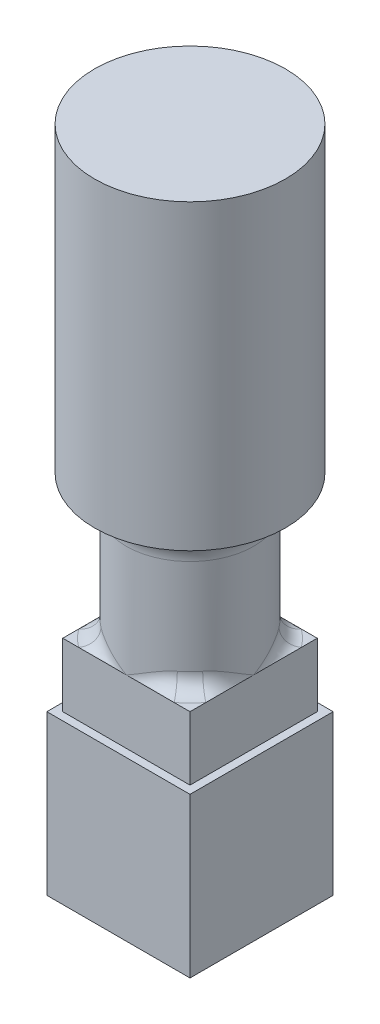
ISO-10303-21;
HEADER;
FILE_DESCRIPTION(('STEP AP214'),'2;1');
FILE_NAME('part.step','',(''),(''),'','','');
FILE_SCHEMA(('AUTOMOTIVE_DESIGN { 1 0 10303 214 1 1 1 1 }'));
ENDSEC;
DATA;
#1=APPLICATION_CONTEXT('core data for automotive mechanical design processes');
#2=APPLICATION_PROTOCOL_DEFINITION('international standard','automotive_design',2000,#1);
#3=PRODUCT_CONTEXT('',#1,'mechanical');
#4=PRODUCT('Part','Part','',(#3));
#5=PRODUCT_RELATED_PRODUCT_CATEGORY('part','',(#4));
#6=PRODUCT_DEFINITION_FORMATION('','',#4);
#7=PRODUCT_DEFINITION_CONTEXT('part definition',#1,'design');
#8=PRODUCT_DEFINITION('design','',#6,#7);
#9=PRODUCT_DEFINITION_SHAPE('','',#8);
#10=(LENGTH_UNIT() NAMED_UNIT(*) SI_UNIT(.MILLI.,.METRE.));
#11=(NAMED_UNIT(*) PLANE_ANGLE_UNIT() SI_UNIT($,.RADIAN.));
#12=(NAMED_UNIT(*) SI_UNIT($,.STERADIAN.) SOLID_ANGLE_UNIT());
#13=UNCERTAINTY_MEASURE_WITH_UNIT(LENGTH_MEASURE(1.E-05),#10,'distance_accuracy_value','');
#14=(GEOMETRIC_REPRESENTATION_CONTEXT(3) GLOBAL_UNCERTAINTY_ASSIGNED_CONTEXT((#13)) GLOBAL_UNIT_ASSIGNED_CONTEXT((#10,
#11,#12)) REPRESENTATION_CONTEXT('',''));
#15=CARTESIAN_POINT('',(0.,0.,0.));
#16=DIRECTION('',(0.,0.,1.));
#17=DIRECTION('',(1.,0.,0.));
#18=AXIS2_PLACEMENT_3D('',#15,#16,#17);
#19=CARTESIAN_POINT('',(0.,-95.,0.));
#20=DIRECTION('',(0.,1.,0.));
#21=DIRECTION('',(0.,0.,1.));
#22=AXIS2_PLACEMENT_3D('',#19,#20,#21);
#23=CYLINDRICAL_SURFACE('',#22,30.);
#24=CARTESIAN_POINT('',(0.,-95.,0.));
#25=DIRECTION('',(0.,1.,0.));
#26=DIRECTION('',(0.,0.,1.));
#27=AXIS2_PLACEMENT_3D('',#24,#25,#26);
#28=CIRCLE('',#27,30.);
#29=CARTESIAN_POINT('',(0.,-95.,30.));
#30=VERTEX_POINT('',#29);
#31=EDGE_CURVE('E242',#30,#30,#28,.T.);
#32=ORIENTED_EDGE('',*,*,#31,.T.);
#33=EDGE_LOOP('',(#32));
#34=FACE_BOUND('',#33,.T.);
#35=CARTESIAN_POINT('',(0.,0.,0.));
#36=DIRECTION('',(0.,1.,0.));
#37=DIRECTION('',(0.,0.,1.));
#38=AXIS2_PLACEMENT_3D('',#35,#36,#37);
#39=CIRCLE('',#38,30.);
#40=CARTESIAN_POINT('',(0.,0.,30.));
#41=VERTEX_POINT('',#40);
#42=EDGE_CURVE('E241',#41,#41,#39,.T.);
#43=ORIENTED_EDGE('',*,*,#42,.F.);
#44=EDGE_LOOP('',(#43));
#45=FACE_BOUND('',#44,.T.);
#46=ADVANCED_FACE('F32',(#34,#45),#23,.T.);
#47=CARTESIAN_POINT('',(0.,0.,0.));
#48=DIRECTION('',(0.,1.,0.));
#49=DIRECTION('',(0.,0.,1.));
#50=AXIS2_PLACEMENT_3D('',#47,#48,#49);
#51=PLANE('',#50);
#52=ORIENTED_EDGE('',*,*,#42,.T.);
#53=EDGE_LOOP('',(#52));
#54=FACE_BOUND('',#53,.T.);
#55=ADVANCED_FACE('F566',(#54),#51,.T.);
#56=CARTESIAN_POINT('',(0.,-140.,0.));
#57=DIRECTION('',(0.,1.,0.));
#58=DIRECTION('',(0.,0.,1.));
#59=AXIS2_PLACEMENT_3D('',#56,#57,#58);
#60=CYLINDRICAL_SURFACE('',#59,20.);
#61=CARTESIAN_POINT('',(0.,-105.,0.));
#62=DIRECTION('',(0.,1.,0.));
#63=DIRECTION('',(0.,0.,1.));
#64=AXIS2_PLACEMENT_3D('',#61,#62,#63);
#65=CIRCLE('',#64,20.);
#66=CARTESIAN_POINT('',(0.,-105.,20.));
#67=VERTEX_POINT('',#66);
#68=EDGE_CURVE('E245',#67,#67,#65,.F.);
#69=ORIENTED_EDGE('',*,*,#68,.T.);
#70=EDGE_LOOP('',(#69));
#71=FACE_BOUND('',#70,.T.);
#72=CARTESIAN_POINT('',(14.382591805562,-135.42698288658,13.8975196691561));
#73=CARTESIAN_POINT('',(15.7590537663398,-141.874949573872,12.4730143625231));
#74=CARTESIAN_POINT('',(20.,-140.,17.3718995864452));
#75=CARTESIAN_POINT('',(14.5213192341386,-135.350388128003,13.7540056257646));
#76=CARTESIAN_POINT('',(15.7088791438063,-141.70739260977,12.49694004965));
#77=CARTESIAN_POINT('',(20.,-140.,17.1925070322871));
#78=CARTESIAN_POINT('',(14.6597120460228,-135.28561611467,13.6064295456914));
#79=CARTESIAN_POINT('',(15.6810185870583,-141.535720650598,12.5033163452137));
#80=CARTESIAN_POINT('',(20.,-140.,17.0080369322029));
#81=CARTESIAN_POINT('',(14.9340631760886,-135.177442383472,13.3046921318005));
#82=CARTESIAN_POINT('',(15.6640888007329,-141.199005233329,12.4824817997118));
#83=CARTESIAN_POINT('',(20.,-140.,16.6308651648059));
#84=CARTESIAN_POINT('',(15.0700257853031,-135.133998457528,13.1505444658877));
#85=CARTESIAN_POINT('',(15.6738188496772,-141.033775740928,12.4563126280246));
#86=CARTESIAN_POINT('',(20.,-140.,16.4381805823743));
#87=CARTESIAN_POINT('',(15.3369373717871,-135.066269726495,12.838233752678));
#88=CARTESIAN_POINT('',(15.7229852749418,-140.71870575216,12.3746893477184));
#89=CARTESIAN_POINT('',(20.,-140.,16.047792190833));
#90=CARTESIAN_POINT('',(15.46792348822,-135.041792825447,12.6801281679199));
#91=CARTESIAN_POINT('',(15.7613096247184,-140.568338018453,12.3203362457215));
#92=CARTESIAN_POINT('',(20.,-140.,15.8501602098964));
#93=CARTESIAN_POINT('',(15.725523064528,-135.009159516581,12.3592187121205));
#94=CARTESIAN_POINT('',(15.8596091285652,-140.284397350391,12.1866248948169));
#95=CARTESIAN_POINT('',(20.,-140.,15.4490233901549));
#96=CARTESIAN_POINT('',(15.8521335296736,-135.001014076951,12.1964117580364));
#97=CARTESIAN_POINT('',(15.9190697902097,-140.150309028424,12.1078543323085));
#98=CARTESIAN_POINT('',(20.,-140.,15.2455146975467));
#99=CARTESIAN_POINT('',(16.1703973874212,-134.998639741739,11.7737995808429));
#100=CARTESIAN_POINT('',(16.0900489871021,-139.832167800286,11.8799993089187));
#101=CARTESIAN_POINT('',(20.,-140.,14.7172494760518));
#102=CARTESIAN_POINT('',(16.3583752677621,-135.014876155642,11.5111707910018));
#103=CARTESIAN_POINT('',(16.2128880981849,-139.65753027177,11.7152181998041));
#104=CARTESIAN_POINT('',(20.,-140.,14.3889634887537));
#105=CARTESIAN_POINT('',(16.7204210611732,-135.076462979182,10.9786765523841));
#106=CARTESIAN_POINT('',(16.4777844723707,-139.353634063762,11.3451542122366));
#107=CARTESIAN_POINT('',(20.,-140.,13.7233456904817));
#108=CARTESIAN_POINT('',(16.8944841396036,-135.121823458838,10.7088086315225));
#109=CARTESIAN_POINT('',(16.6194983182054,-139.222524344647,11.1408057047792));
#110=CARTESIAN_POINT('',(20.,-140.,13.3860107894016));
#111=CARTESIAN_POINT('',(17.2291207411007,-135.236931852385,10.1617350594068));
#112=CARTESIAN_POINT('',(16.9103875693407,-139.000735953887,10.699939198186));
#113=CARTESIAN_POINT('',(20.,-140.,12.7021688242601));
#114=CARTESIAN_POINT('',(17.3896013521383,-135.306833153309,9.88449363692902));
#115=CARTESIAN_POINT('',(17.0597789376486,-138.908786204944,10.4635943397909));
#116=CARTESIAN_POINT('',(20.,-140.,12.3556170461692));
#117=CARTESIAN_POINT('',(17.6956686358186,-135.466751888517,9.32549933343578));
#118=CARTESIAN_POINT('',(17.3567901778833,-138.761080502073,9.96709182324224));
#119=CARTESIAN_POINT('',(20.,-140.,11.6568741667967));
#120=CARTESIAN_POINT('',(17.8412500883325,-135.55677633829,9.0437449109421));
#121=CARTESIAN_POINT('',(17.504816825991,-138.704195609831,9.70695675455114));
#122=CARTESIAN_POINT('',(20.,-140.,11.3046811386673));
#123=CARTESIAN_POINT('',(18.1987091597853,-135.811206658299,8.31009087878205));
#124=CARTESIAN_POINT('',(17.8756787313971,-138.597691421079,9.01507497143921));
#125=CARTESIAN_POINT('',(20.,-140.,10.3876135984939));
#126=CARTESIAN_POINT('',(18.3992990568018,-135.988242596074,7.85546241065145));
#127=CARTESIAN_POINT('',(18.0971519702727,-138.568184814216,8.5638844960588));
#128=CARTESIAN_POINT('',(20.,-140.,9.81932801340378));
#129=CARTESIAN_POINT('',(18.7638351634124,-136.373240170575,6.93985628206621));
#130=CARTESIAN_POINT('',(18.5077978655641,-138.568501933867,7.63199057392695));
#131=CARTESIAN_POINT('',(20.,-140.,8.67482035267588));
#132=CARTESIAN_POINT('',(18.9277588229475,-136.581220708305,6.47887489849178));
#133=CARTESIAN_POINT('',(18.6990826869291,-138.596622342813,7.14944718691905));
#134=CARTESIAN_POINT('',(20.,-140.,8.09859362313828));
#135=CARTESIAN_POINT('',(19.2197472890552,-137.019539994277,5.55307331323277));
#136=CARTESIAN_POINT('',(19.0431745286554,-138.695879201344,6.16609504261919));
#137=CARTESIAN_POINT('',(20.,-140.,6.94134164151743));
#138=CARTESIAN_POINT('',(19.3478503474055,-137.249854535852,5.08825775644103));
#139=CARTESIAN_POINT('',(19.1978314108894,-138.766258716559,5.66305770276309));
#140=CARTESIAN_POINT('',(20.,-140.,6.36032219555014));
#141=CARTESIAN_POINT('',(19.5693221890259,-137.72633899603,4.15585830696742));
#142=CARTESIAN_POINT('',(19.4662224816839,-138.936955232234,4.6457030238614));
#143=CARTESIAN_POINT('',(20.,-140.,5.19482288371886));
#144=CARTESIAN_POINT('',(19.6627042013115,-137.97250283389,3.6882755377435));
#145=CARTESIAN_POINT('',(19.5813695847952,-139.037201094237,4.12891332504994));
#146=CARTESIAN_POINT('',(20.,-140.,4.61034442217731));
#147=CARTESIAN_POINT('',(19.8258276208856,-138.509079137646,2.68823910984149));
#148=CARTESIAN_POINT('',(19.7822858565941,-139.271509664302,3.02015617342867));
#149=CARTESIAN_POINT('',(20.,-140.,3.3602988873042));
#150=CARTESIAN_POINT('',(19.8907066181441,-138.800992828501,2.15551082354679));
#151=CARTESIAN_POINT('',(19.863519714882,-139.408982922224,2.42289221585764));
#152=CARTESIAN_POINT('',(20.,-140.,2.69438852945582));
#153=CARTESIAN_POINT('',(19.9774508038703,-139.390995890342,1.08948909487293));
#154=CARTESIAN_POINT('',(19.9715982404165,-139.695079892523,1.22759833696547));
#155=CARTESIAN_POINT('',(20.,-140.,1.36186136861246));
#156=CARTESIAN_POINT('',(19.9993712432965,-139.689076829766,0.556197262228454));
#157=CARTESIAN_POINT('',(19.9992116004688,-139.844532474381,0.625749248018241));
#158=CARTESIAN_POINT('',(20.,-140.,0.695246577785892));
#159=CARTESIAN_POINT('',(19.9999955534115,-139.991393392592,0.0153959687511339));
#160=CARTESIAN_POINT('',(19.999994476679,-139.995696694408,0.0173204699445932));
#161=CARTESIAN_POINT('',(20.,-140.,0.0192449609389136));
#162=CARTESIAN_POINT('',(19.9999999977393,-139.995696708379,0.00769796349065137));
#163=CARTESIAN_POINT('',(20.0000000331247,-139.997848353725,0.00866020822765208));
#164=CARTESIAN_POINT('',(20.,-140.,0.00962245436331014));
#165=CARTESIAN_POINT('',(20.,-140.,0.));
#166=CARTESIAN_POINT('',(20.,-140.,0.));
#167=CARTESIAN_POINT('',(20.,-140.,0.));
#168=(BOUNDED_SURFACE() B_SPLINE_SURFACE(3,2,((#72,#73,#74),(#75,#76,#77),(#78,#79,#80),(#81,
#82,#83),(#84,#85,#86),(#87,#88,#89),(#90,#91,#92),(#93,#94,#95),(#96,#97,#98),(#99,#100,#101),
(#102,#103,#104),(#105,#106,#107),(#108,#109,#110),(#111,#112,#113),(#114,#115,#116),(#117,#118,
#119),(#120,#121,#122),(#123,#124,#125),(#126,#127,#128),(#129,#130,#131),(#132,#133,#134),
(#135,#136,#137),(#138,#139,#140),(#141,#142,#143),(#144,#145,#146),(#147,#148,#149),(#150,#151,
#152),(#153,#154,#155),(#156,#157,#158),(#159,#160,#161),(#162,#163,#164),(#165,#166,#167)),
.UNSPECIFIED.,.F.,.F.,.F.) B_SPLINE_SURFACE_WITH_KNOTS((4,2,2,2,2,2,2,2,2,2,2,2,2,2,2,4),(3,3),
(0.,0.782301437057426,1.56304840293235,2.33578077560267,3.10903194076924,4.31924472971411,
5.52987619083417,6.74821325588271,7.9669757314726,9.90162585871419,11.8374625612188,
13.7712240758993,15.7042480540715,17.8970038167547,20.0869375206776,20.1185603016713),(0.,1.),
.UNSPECIFIED.) GEOMETRIC_REPRESENTATION_ITEM() RATIONAL_B_SPLINE_SURFACE(((1.,0.595490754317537,
1.),(1.,0.60478369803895,1.),(1.,0.614140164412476,1.),(1.,0.632832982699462,1.),(1.,
0.642169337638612,1.),(1.,0.660617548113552,1.),(1.,0.669730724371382,1.),(1.,0.687750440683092,
1.),(1.,0.696656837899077,1.),(1.,0.719147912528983,1.),(1.,0.73253215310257,1.),(1.,
0.758451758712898,1.),(1.,0.770986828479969,1.),(1.,0.795188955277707,1.),(1.,0.806849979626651,
1.),(1.,0.829165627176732,1.),(1.,0.839819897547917,1.),(1.,0.866050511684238,1.),(1.,
0.880842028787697,1.),(1.,0.907799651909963,1.),(1.,0.919964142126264,1.),(1.,0.941674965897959,
1.),(1.,0.951224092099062,1.),(1.,0.967754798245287,1.),(1.,0.9747373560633,1.),(1.,
0.98694418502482,1.),(1.,0.991806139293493,1.),(1.,0.998308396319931,1.),(1.,0.999952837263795,
1.),(1.,0.999999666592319,1.),(1.,0.99999999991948,1.),(1.,1.,1.))) REPRESENTATION_ITEM('') SURFACE());
#169=CARTESIAN_POINT('',(14.382591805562,-135.42698288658,13.8975196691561));
#170=CARTESIAN_POINT('',(14.5213192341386,-135.350388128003,13.7540056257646));
#171=CARTESIAN_POINT('',(14.6597120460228,-135.28561611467,13.6064295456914));
#172=CARTESIAN_POINT('',(14.9340631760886,-135.177442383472,13.3046921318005));
#173=CARTESIAN_POINT('',(15.0700257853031,-135.133998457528,13.1505444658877));
#174=CARTESIAN_POINT('',(15.3369373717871,-135.066269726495,12.838233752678));
#175=CARTESIAN_POINT('',(15.46792348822,-135.041792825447,12.6801281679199));
#176=CARTESIAN_POINT('',(15.725523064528,-135.009159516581,12.3592187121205));
#177=CARTESIAN_POINT('',(15.8521335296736,-135.001014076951,12.1964117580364));
#178=CARTESIAN_POINT('',(16.1703973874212,-134.998639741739,11.7737995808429));
#179=CARTESIAN_POINT('',(16.3583752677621,-135.014876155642,11.5111707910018));
#180=CARTESIAN_POINT('',(16.7204210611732,-135.076462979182,10.9786765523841));
#181=CARTESIAN_POINT('',(16.8944841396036,-135.121823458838,10.7088086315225));
#182=CARTESIAN_POINT('',(17.2291207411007,-135.236931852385,10.1617350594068));
#183=CARTESIAN_POINT('',(17.3896013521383,-135.306833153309,9.88449363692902));
#184=CARTESIAN_POINT('',(17.6956686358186,-135.466751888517,9.32549933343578));
#185=CARTESIAN_POINT('',(17.8412500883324,-135.55677633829,9.0437449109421));
#186=CARTESIAN_POINT('',(18.1987091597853,-135.811206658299,8.31009087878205));
#187=CARTESIAN_POINT('',(18.3992990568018,-135.988242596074,7.85546241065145));
#188=CARTESIAN_POINT('',(18.7638351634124,-136.373240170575,6.93985628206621));
#189=CARTESIAN_POINT('',(18.9277588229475,-136.581220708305,6.47887489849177));
#190=CARTESIAN_POINT('',(19.2197472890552,-137.019539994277,5.55307331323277));
#191=CARTESIAN_POINT('',(19.3478503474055,-137.249854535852,5.08825775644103));
#192=CARTESIAN_POINT('',(19.5693221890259,-137.72633899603,4.15585830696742));
#193=CARTESIAN_POINT('',(19.6627042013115,-137.97250283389,3.6882755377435));
#194=CARTESIAN_POINT('',(19.8258276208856,-138.509079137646,2.68823910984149));
#195=CARTESIAN_POINT('',(19.8907066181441,-138.800992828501,2.1555108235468));
#196=CARTESIAN_POINT('',(19.9774508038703,-139.390995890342,1.08948909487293));
#197=CARTESIAN_POINT('',(19.9993712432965,-139.689076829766,0.556197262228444));
#198=CARTESIAN_POINT('',(19.9999955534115,-139.991393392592,0.0153959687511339));
#199=CARTESIAN_POINT('',(19.9999999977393,-139.995696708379,0.00769796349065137));
#200=CARTESIAN_POINT('',(20.,-140.,0.));
#201=B_SPLINE_CURVE_WITH_KNOTS('',3,(#169,#170,#171,#172,#173,#174,#175,#176,#177,#178,#179,
#180,#181,#182,#183,#184,#185,#186,#187,#188,#189,#190,#191,#192,#193,#194,#195,#196,#197,#198,
#199,#200),.UNSPECIFIED.,.F.,.F.,(4,2,2,2,2,2,2,2,2,2,2,2,2,2,2,4),(0.,0.782301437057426,
1.56304840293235,2.33578077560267,3.10903194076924,4.31924472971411,5.52987619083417,
6.74821325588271,7.9669757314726,9.90162585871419,11.8374625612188,13.7712240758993,
15.7042480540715,17.8970038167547,20.0869375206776,20.1185603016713),.UNSPECIFIED.);
#202=CARTESIAN_POINT('',(16.0000000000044,-135.,11.9999999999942));
#203=VERTEX_POINT('',#202);
#204=CARTESIAN_POINT('',(20.,-140.,0.));
#205=VERTEX_POINT('',#204);
#206=EDGE_CURVE('E252',#203,#205,#201,.T.);
#207=ORIENTED_EDGE('',*,*,#206,.T.);
#208=CARTESIAN_POINT('',(20.,-140.,-17.371899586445));
#209=CARTESIAN_POINT('',(15.7590537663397,-141.874949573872,-12.4730143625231));
#210=CARTESIAN_POINT('',(14.3825918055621,-135.42698288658,-13.897519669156));
#211=CARTESIAN_POINT('',(20.,-140.,-17.192507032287));
#212=CARTESIAN_POINT('',(15.7088791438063,-141.70739260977,-12.49694004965));
#213=CARTESIAN_POINT('',(14.5213192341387,-135.350388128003,-13.7540056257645));
#214=CARTESIAN_POINT('',(20.,-140.,-17.0080369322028));
#215=CARTESIAN_POINT('',(15.6810185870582,-141.535720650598,-12.5033163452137));
#216=CARTESIAN_POINT('',(14.6597120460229,-135.28561611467,-13.6064295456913));
#217=CARTESIAN_POINT('',(20.,-140.,-16.6308651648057));
#218=CARTESIAN_POINT('',(15.6640888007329,-141.199005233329,-12.4824817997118));
#219=CARTESIAN_POINT('',(14.9340631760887,-135.177442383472,-13.3046921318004));
#220=CARTESIAN_POINT('',(20.,-140.,-16.4381805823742));
#221=CARTESIAN_POINT('',(15.6738188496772,-141.033775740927,-12.4563126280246));
#222=CARTESIAN_POINT('',(15.0700257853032,-135.133998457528,-13.1505444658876));
#223=CARTESIAN_POINT('',(20.,-140.,-16.0477921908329));
#224=CARTESIAN_POINT('',(15.7229852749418,-140.71870575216,-12.3746893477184));
#225=CARTESIAN_POINT('',(15.3369373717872,-135.066269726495,-12.8382337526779));
#226=CARTESIAN_POINT('',(20.,-140.,-15.8501602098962));
#227=CARTESIAN_POINT('',(15.7613096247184,-140.568338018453,-12.3203362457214));
#228=CARTESIAN_POINT('',(15.4679234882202,-135.041792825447,-12.6801281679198));
#229=CARTESIAN_POINT('',(20.,-140.,-15.4490233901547));
#230=CARTESIAN_POINT('',(15.8596091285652,-140.28439735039,-12.1866248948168));
#231=CARTESIAN_POINT('',(15.7255230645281,-135.009159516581,-12.3592187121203));
#232=CARTESIAN_POINT('',(20.,-140.,-15.2455146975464));
#233=CARTESIAN_POINT('',(15.9190697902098,-140.150309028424,-12.1078543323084));
#234=CARTESIAN_POINT('',(15.8521335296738,-135.001014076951,-12.1964117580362));
#235=CARTESIAN_POINT('',(20.,-140.,-14.7172494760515));
#236=CARTESIAN_POINT('',(16.0900489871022,-139.832167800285,-11.8799993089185));
#237=CARTESIAN_POINT('',(16.1703973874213,-134.998639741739,-11.7737995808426));
#238=CARTESIAN_POINT('',(20.,-140.,-14.3889634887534));
#239=CARTESIAN_POINT('',(16.212888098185,-139.65753027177,-11.715218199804));
#240=CARTESIAN_POINT('',(16.3583752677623,-135.014876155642,-11.5111707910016));
#241=CARTESIAN_POINT('',(20.,-140.,-13.7233456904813));
#242=CARTESIAN_POINT('',(16.4777844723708,-139.353634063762,-11.3451542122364));
#243=CARTESIAN_POINT('',(16.7204210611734,-135.076462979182,-10.9786765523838));
#244=CARTESIAN_POINT('',(20.,-140.,-13.3860107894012));
#245=CARTESIAN_POINT('',(16.6194983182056,-139.222524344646,-11.140805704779));
#246=CARTESIAN_POINT('',(16.8944841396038,-135.121823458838,-10.7088086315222));
#247=CARTESIAN_POINT('',(20.,-140.,-12.7021688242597));
#248=CARTESIAN_POINT('',(16.9103875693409,-139.000735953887,-10.6999391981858));
#249=CARTESIAN_POINT('',(17.2291207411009,-135.236931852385,-10.1617350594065));
#250=CARTESIAN_POINT('',(20.,-140.,-12.3556170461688));
#251=CARTESIAN_POINT('',(17.0597789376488,-138.908786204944,-10.4635943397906));
#252=CARTESIAN_POINT('',(17.3896013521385,-135.30683315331,-9.88449363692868));
#253=CARTESIAN_POINT('',(20.,-140.,-11.6568741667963));
#254=CARTESIAN_POINT('',(17.3567901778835,-138.761080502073,-9.96709182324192));
#255=CARTESIAN_POINT('',(17.6956686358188,-135.466751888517,-9.32549933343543));
#256=CARTESIAN_POINT('',(20.,-140.,-11.3046811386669));
#257=CARTESIAN_POINT('',(17.5048168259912,-138.704195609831,-9.7069567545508));
#258=CARTESIAN_POINT('',(17.8412500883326,-135.55677633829,-9.04374491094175));
#259=CARTESIAN_POINT('',(20.,-140.,-10.3876135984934));
#260=CARTESIAN_POINT('',(17.8756787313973,-138.597691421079,-9.01507497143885));
#261=CARTESIAN_POINT('',(18.1987091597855,-135.811206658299,-8.31009087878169));
#262=CARTESIAN_POINT('',(20.,-140.,-9.81932801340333));
#263=CARTESIAN_POINT('',(18.0971519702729,-138.568184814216,-8.56388449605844));
#264=CARTESIAN_POINT('',(18.399299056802,-135.988242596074,-7.8554624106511));
#265=CARTESIAN_POINT('',(20.,-140.,-8.67482035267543));
#266=CARTESIAN_POINT('',(18.5077978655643,-138.568501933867,-7.63199057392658));
#267=CARTESIAN_POINT('',(18.7638351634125,-136.373240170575,-6.93985628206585));
#268=CARTESIAN_POINT('',(20.,-140.,-8.09859362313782));
#269=CARTESIAN_POINT('',(18.6990826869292,-138.596622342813,-7.14944718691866));
#270=CARTESIAN_POINT('',(18.9277588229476,-136.581220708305,-6.47887489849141));
#271=CARTESIAN_POINT('',(20.,-140.,-6.94134164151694));
#272=CARTESIAN_POINT('',(19.0431745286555,-138.695879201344,-6.16609504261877));
#273=CARTESIAN_POINT('',(19.2197472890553,-137.019539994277,-5.55307331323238));
#274=CARTESIAN_POINT('',(20.,-140.,-6.36032219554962));
#275=CARTESIAN_POINT('',(19.1978314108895,-138.766258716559,-5.66305770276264));
#276=CARTESIAN_POINT('',(19.3478503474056,-137.249854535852,-5.08825775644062));
#277=CARTESIAN_POINT('',(20.,-140.,-5.1948228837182));
#278=CARTESIAN_POINT('',(19.4662224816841,-138.936955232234,-4.64570302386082));
#279=CARTESIAN_POINT('',(19.569322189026,-137.72633899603,-4.1558583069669));
#280=CARTESIAN_POINT('',(20.,-140.,-4.61034442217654));
#281=CARTESIAN_POINT('',(19.5813695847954,-139.037201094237,-4.12891332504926));
#282=CARTESIAN_POINT('',(19.6627042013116,-137.97250283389,-3.68827553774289));
#283=CARTESIAN_POINT('',(20.,-140.,-3.36029888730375));
#284=CARTESIAN_POINT('',(19.7822858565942,-139.271509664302,-3.02015617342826));
#285=CARTESIAN_POINT('',(19.8258276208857,-138.509079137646,-2.68823910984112));
#286=CARTESIAN_POINT('',(20.,-140.,-2.69438852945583));
#287=CARTESIAN_POINT('',(19.8635197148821,-139.408982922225,-2.42289221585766));
#288=CARTESIAN_POINT('',(19.8907066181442,-138.800992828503,-2.1555108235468));
#289=CARTESIAN_POINT('',(20.,-140.,-1.36186136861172));
#290=CARTESIAN_POINT('',(19.9715982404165,-139.695079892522,-1.2275983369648));
#291=CARTESIAN_POINT('',(19.9774508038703,-139.390995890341,-1.08948909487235));
#292=CARTESIAN_POINT('',(20.,-140.,-0.695246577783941));
#293=CARTESIAN_POINT('',(19.9992116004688,-139.84453247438,-0.625749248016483));
#294=CARTESIAN_POINT('',(19.9993712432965,-139.689076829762,-0.55619726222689));
#295=CARTESIAN_POINT('',(20.,-140.,-0.0192449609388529));
#296=CARTESIAN_POINT('',(19.999994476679,-139.995696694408,-0.0173204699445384));
#297=CARTESIAN_POINT('',(19.9999955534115,-139.991393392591,-0.0153959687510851));
#298=CARTESIAN_POINT('',(20.,-140.,-0.00962245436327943));
#299=CARTESIAN_POINT('',(20.0000000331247,-139.997848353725,-0.0086602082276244));
#300=CARTESIAN_POINT('',(19.9999999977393,-139.995696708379,-0.00769796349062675));
#301=CARTESIAN_POINT('',(20.,-140.,0.));
#302=CARTESIAN_POINT('',(20.,-140.,0.));
#303=CARTESIAN_POINT('',(20.,-140.,0.));
#304=(BOUNDED_SURFACE() B_SPLINE_SURFACE(3,2,((#208,#209,#210),(#211,#212,#213),(#214,#215,
#216),(#217,#218,#219),(#220,#221,#222),(#223,#224,#225),(#226,#227,#228),(#229,#230,#231),
(#232,#233,#234),(#235,#236,#237),(#238,#239,#240),(#241,#242,#243),(#244,#245,#246),(#247,#248,
#249),(#250,#251,#252),(#253,#254,#255),(#256,#257,#258),(#259,#260,#261),(#262,#263,#264),
(#265,#266,#267),(#268,#269,#270),(#271,#272,#273),(#274,#275,#276),(#277,#278,#279),(#280,#281,
#282),(#283,#284,#285),(#286,#287,#288),(#289,#290,#291),(#292,#293,#294),(#295,#296,#297),
(#298,#299,#300),(#301,#302,#303)),.UNSPECIFIED.,.F.,.F.,.F.) B_SPLINE_SURFACE_WITH_KNOTS((4,2,
2,2,2,2,2,2,2,2,2,2,2,2,2,4),(3,3),(0.,0.782301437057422,1.56304840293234,2.33578077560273,
3.10903194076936,4.31924472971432,5.52987619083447,6.74821325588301,7.96697573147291,
9.90162585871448,11.8374625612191,13.7712240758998,15.7042480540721,17.8970038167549,
20.0869375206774,20.1185603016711),(0.,1.),
.UNSPECIFIED.) GEOMETRIC_REPRESENTATION_ITEM() RATIONAL_B_SPLINE_SURFACE(((1.,0.595490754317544,
1.),(1.,0.604783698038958,1.),(1.,0.614140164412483,1.),(1.,0.63283298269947,1.),(1.,
0.642169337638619,1.),(1.,0.660617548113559,1.),(1.,0.66973072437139,1.),(1.,0.687750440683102,
1.),(1.,0.696656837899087,1.),(1.,0.719147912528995,1.),(1.,0.732532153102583,1.),(1.,
0.758451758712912,1.),(1.,0.770986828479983,1.),(1.,0.795188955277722,1.),(1.,0.806849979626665,
1.),(1.,0.829165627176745,1.),(1.,0.83981989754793,1.),(1.,0.86605051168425,1.),(1.,
0.880842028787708,1.),(1.,0.907799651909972,1.),(1.,0.919964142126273,1.),(1.,0.941674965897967,
1.),(1.,0.95122409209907,1.),(1.,0.967754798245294,1.),(1.,0.974737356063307,1.),(1.,
0.986944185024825,1.),(1.,0.991806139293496,1.),(1.,0.998308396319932,1.),(1.,0.999952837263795,
1.),(1.,0.999999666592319,1.),(1.,0.99999999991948,1.),(1.,1.,1.))) REPRESENTATION_ITEM('') SURFACE());
#305=CARTESIAN_POINT('',(14.3825918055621,-135.42698288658,-13.897519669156));
#306=CARTESIAN_POINT('',(14.5213192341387,-135.350388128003,-13.7540056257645));
#307=CARTESIAN_POINT('',(14.6597120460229,-135.28561611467,-13.6064295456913));
#308=CARTESIAN_POINT('',(14.9340631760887,-135.177442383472,-13.3046921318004));
#309=CARTESIAN_POINT('',(15.0700257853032,-135.133998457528,-13.1505444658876));
#310=CARTESIAN_POINT('',(15.3369373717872,-135.066269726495,-12.8382337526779));
#311=CARTESIAN_POINT('',(15.4679234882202,-135.041792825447,-12.6801281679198));
#312=CARTESIAN_POINT('',(15.7255230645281,-135.009159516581,-12.3592187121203));
#313=CARTESIAN_POINT('',(15.8521335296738,-135.001014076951,-12.1964117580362));
#314=CARTESIAN_POINT('',(16.1703973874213,-134.998639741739,-11.7737995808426));
#315=CARTESIAN_POINT('',(16.3583752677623,-135.014876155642,-11.5111707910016));
#316=CARTESIAN_POINT('',(16.7204210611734,-135.076462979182,-10.9786765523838));
#317=CARTESIAN_POINT('',(16.8944841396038,-135.121823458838,-10.7088086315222));
#318=CARTESIAN_POINT('',(17.2291207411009,-135.236931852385,-10.1617350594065));
#319=CARTESIAN_POINT('',(17.3896013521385,-135.30683315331,-9.88449363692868));
#320=CARTESIAN_POINT('',(17.6956686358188,-135.466751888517,-9.32549933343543));
#321=CARTESIAN_POINT('',(17.8412500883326,-135.55677633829,-9.04374491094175));
#322=CARTESIAN_POINT('',(18.1987091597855,-135.811206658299,-8.31009087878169));
#323=CARTESIAN_POINT('',(18.399299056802,-135.988242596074,-7.8554624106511));
#324=CARTESIAN_POINT('',(18.7638351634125,-136.373240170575,-6.93985628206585));
#325=CARTESIAN_POINT('',(18.9277588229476,-136.581220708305,-6.47887489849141));
#326=CARTESIAN_POINT('',(19.2197472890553,-137.019539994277,-5.55307331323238));
#327=CARTESIAN_POINT('',(19.3478503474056,-137.249854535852,-5.08825775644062));
#328=CARTESIAN_POINT('',(19.569322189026,-137.72633899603,-4.1558583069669));
#329=CARTESIAN_POINT('',(19.6627042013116,-137.97250283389,-3.68827553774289));
#330=CARTESIAN_POINT('',(19.8258276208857,-138.509079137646,-2.68823910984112));
#331=CARTESIAN_POINT('',(19.8907066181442,-138.800992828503,-2.15551082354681));
#332=CARTESIAN_POINT('',(19.9774508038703,-139.390995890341,-1.08948909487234));
#333=CARTESIAN_POINT('',(19.9993712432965,-139.689076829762,-0.556197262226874));
#334=CARTESIAN_POINT('',(19.9999955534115,-139.991393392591,-0.0153959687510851));
#335=CARTESIAN_POINT('',(19.9999999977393,-139.995696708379,-0.00769796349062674));
#336=CARTESIAN_POINT('',(20.,-140.,0.));
#337=B_SPLINE_CURVE_WITH_KNOTS('',3,(#305,#306,#307,#308,#309,#310,#311,#312,#313,#314,#315,
#316,#317,#318,#319,#320,#321,#322,#323,#324,#325,#326,#327,#328,#329,#330,#331,#332,#333,#334,
#335,#336),.UNSPECIFIED.,.F.,.F.,(4,2,2,2,2,2,2,2,2,2,2,2,2,2,2,4),(0.,0.782301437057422,
1.56304840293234,2.33578077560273,3.10903194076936,4.31924472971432,5.52987619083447,
6.74821325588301,7.96697573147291,9.90162585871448,11.8374625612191,13.7712240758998,
15.7042480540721,17.8970038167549,20.0869375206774,20.1185603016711),.UNSPECIFIED.);
#338=CARTESIAN_POINT('',(16.,-135.,-12.));
#339=VERTEX_POINT('',#338);
#340=EDGE_CURVE('E522',#205,#339,#337,.F.);
#341=ORIENTED_EDGE('',*,*,#340,.T.);
#342=CARTESIAN_POINT('',(0.,-135.,0.));
#343=DIRECTION('',(0.,-1.,0.));
#344=DIRECTION('',(0.,0.,-1.));
#345=AXIS2_PLACEMENT_3D('',#342,#343,#344);
#346=CIRCLE('',#345,20.);
#347=CARTESIAN_POINT('',(12.,-135.,-16.));
#348=VERTEX_POINT('',#347);
#349=EDGE_CURVE('E528',#339,#348,#346,.F.);
#350=ORIENTED_EDGE('',*,*,#349,.T.);
#351=CARTESIAN_POINT('',(13.8975196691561,-135.42698288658,-14.382591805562));
#352=CARTESIAN_POINT('',(12.4730143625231,-141.874949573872,-15.7590537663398));
#353=CARTESIAN_POINT('',(17.3718995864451,-140.,-20.));
#354=CARTESIAN_POINT('',(13.7540056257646,-135.350388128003,-14.5213192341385));
#355=CARTESIAN_POINT('',(12.4969400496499,-141.70739260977,-15.7088791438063));
#356=CARTESIAN_POINT('',(17.1925070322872,-140.,-20.));
#357=CARTESIAN_POINT('',(13.6064295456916,-135.28561611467,-14.6597120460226));
#358=CARTESIAN_POINT('',(12.5033163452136,-141.535720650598,-15.6810185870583));
#359=CARTESIAN_POINT('',(17.0080369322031,-140.,-20.));
#360=CARTESIAN_POINT('',(13.3046921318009,-135.177442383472,-14.9340631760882));
#361=CARTESIAN_POINT('',(12.4824817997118,-141.19900523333,-15.6640888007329));
#362=CARTESIAN_POINT('',(16.6308651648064,-140.,-20.));
#363=CARTESIAN_POINT('',(13.1505444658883,-135.133998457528,-15.0700257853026));
#364=CARTESIAN_POINT('',(12.4563126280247,-141.033775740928,-15.6738188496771));
#365=CARTESIAN_POINT('',(16.438180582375,-140.,-20.));
#366=CARTESIAN_POINT('',(12.8382337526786,-135.066269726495,-15.3369373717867));
#367=CARTESIAN_POINT('',(12.3746893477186,-140.71870575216,-15.7229852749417));
#368=CARTESIAN_POINT('',(16.0477921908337,-140.,-20.));
#369=CARTESIAN_POINT('',(12.6801281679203,-135.041792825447,-15.4679234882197));
#370=CARTESIAN_POINT('',(12.3203362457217,-140.568338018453,-15.7613096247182));
#371=CARTESIAN_POINT('',(15.8501602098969,-140.,-20.));
#372=CARTESIAN_POINT('',(12.3592187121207,-135.009159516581,-15.7255230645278));
#373=CARTESIAN_POINT('',(12.186624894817,-140.284397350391,-15.8596091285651));
#374=CARTESIAN_POINT('',(15.4490233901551,-140.,-20.));
#375=CARTESIAN_POINT('',(12.1964117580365,-135.001014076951,-15.8521335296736));
#376=CARTESIAN_POINT('',(12.1078543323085,-140.150309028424,-15.9190697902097));
#377=CARTESIAN_POINT('',(15.2455146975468,-140.,-20.));
#378=CARTESIAN_POINT('',(11.7737995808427,-134.998639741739,-16.1703973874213));
#379=CARTESIAN_POINT('',(11.8799993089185,-139.832167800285,-16.0900489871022));
#380=CARTESIAN_POINT('',(14.7172494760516,-140.,-20.));
#381=CARTESIAN_POINT('',(11.5111707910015,-135.014876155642,-16.3583752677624));
#382=CARTESIAN_POINT('',(11.7152181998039,-139.65753027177,-16.2128880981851));
#383=CARTESIAN_POINT('',(14.3889634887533,-140.,-20.));
#384=CARTESIAN_POINT('',(10.9786765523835,-135.076462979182,-16.7204210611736));
#385=CARTESIAN_POINT('',(11.3451542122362,-139.353634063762,-16.477784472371));
#386=CARTESIAN_POINT('',(13.7233456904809,-140.,-20.));
#387=CARTESIAN_POINT('',(10.7088086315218,-135.121823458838,-16.894484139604));
#388=CARTESIAN_POINT('',(11.1408057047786,-139.222524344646,-16.6194983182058));
#389=CARTESIAN_POINT('',(13.3860107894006,-140.,-20.));
#390=CARTESIAN_POINT('',(10.161735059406,-135.236931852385,-17.2291207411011));
#391=CARTESIAN_POINT('',(10.6999391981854,-139.000735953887,-16.9103875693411));
#392=CARTESIAN_POINT('',(12.7021688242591,-140.,-20.));
#393=CARTESIAN_POINT('',(9.88449363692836,-135.30683315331,-17.3896013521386));
#394=CARTESIAN_POINT('',(10.4635943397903,-138.908786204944,-17.0597789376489));
#395=CARTESIAN_POINT('',(12.3556170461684,-140.,-20.));
#396=CARTESIAN_POINT('',(9.3254993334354,-135.466751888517,-17.6956686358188));
#397=CARTESIAN_POINT('',(9.96709182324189,-138.761080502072,-17.3567901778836));
#398=CARTESIAN_POINT('',(11.6568741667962,-140.,-20.));
#399=CARTESIAN_POINT('',(9.04374491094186,-135.55677633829,-17.8412500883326));
#400=CARTESIAN_POINT('',(9.7069567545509,-138.704195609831,-17.5048168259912));
#401=CARTESIAN_POINT('',(11.304681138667,-140.,-20.));
#402=CARTESIAN_POINT('',(8.31009087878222,-135.811206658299,-18.1987091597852));
#403=CARTESIAN_POINT('',(9.01507497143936,-138.597691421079,-17.8756787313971));
#404=CARTESIAN_POINT('',(10.3876135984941,-140.,-20.));
#405=CARTESIAN_POINT('',(7.85546241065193,-135.988242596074,-18.3992990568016));
#406=CARTESIAN_POINT('',(8.56388449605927,-138.568184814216,-18.0971519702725));
#407=CARTESIAN_POINT('',(9.81932801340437,-140.,-20.));
#408=CARTESIAN_POINT('',(6.93985628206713,-136.373240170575,-18.763835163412));
#409=CARTESIAN_POINT('',(7.63199057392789,-138.568501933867,-18.5077978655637));
#410=CARTESIAN_POINT('',(8.67482035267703,-140.,-20.));
#411=CARTESIAN_POINT('',(6.47887489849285,-136.581220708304,-18.9277588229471));
#412=CARTESIAN_POINT('',(7.14944718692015,-138.596622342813,-18.6990826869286));
#413=CARTESIAN_POINT('',(8.09859362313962,-140.,-20.));
#414=CARTESIAN_POINT('',(5.55307331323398,-137.019539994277,-19.2197472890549));
#415=CARTESIAN_POINT('',(6.16609504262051,-138.695879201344,-19.043174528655));
#416=CARTESIAN_POINT('',(6.94134164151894,-140.,-20.));
#417=CARTESIAN_POINT('',(5.08825775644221,-137.249854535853,-19.3478503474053));
#418=CARTESIAN_POINT('',(5.66305770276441,-138.76625871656,-19.1978314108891));
#419=CARTESIAN_POINT('',(6.36032219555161,-140.,-20.));
#420=CARTESIAN_POINT('',(4.15585830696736,-137.726338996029,-19.5693221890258));
#421=CARTESIAN_POINT('',(4.64570302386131,-138.936955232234,-19.4662224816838));
#422=CARTESIAN_POINT('',(5.19482288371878,-140.,-20.));
#423=CARTESIAN_POINT('',(3.68827553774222,-137.972502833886,-19.6627042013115));
#424=CARTESIAN_POINT('',(4.12891332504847,-139.037201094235,-19.5813695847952));
#425=CARTESIAN_POINT('',(4.6103444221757,-140.,-20.));
#426=CARTESIAN_POINT('',(2.68823910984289,-138.50907913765,-19.8258276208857));
#427=CARTESIAN_POINT('',(3.02015617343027,-139.271509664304,-19.7822858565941));
#428=CARTESIAN_POINT('',(3.36029888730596,-140.,-20.));
#429=CARTESIAN_POINT('',(2.15551082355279,-138.800992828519,-19.8907066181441));
#430=CARTESIAN_POINT('',(2.42289221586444,-139.408982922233,-19.8635197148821));
#431=CARTESIAN_POINT('',(2.69438852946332,-140.,-20.));
#432=CARTESIAN_POINT('',(1.08948909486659,-139.390995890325,-19.9774508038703));
#433=CARTESIAN_POINT('',(1.22759833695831,-139.695079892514,-19.9715982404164));
#434=CARTESIAN_POINT('',(1.36186136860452,-140.,-20.));
#435=CARTESIAN_POINT('',(0.556197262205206,-139.689076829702,-19.9993712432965));
#436=CARTESIAN_POINT('',(0.625749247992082,-139.844532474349,-19.9992116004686));
#437=CARTESIAN_POINT('',(0.695246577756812,-140.,-20.));
#438=CARTESIAN_POINT('',(0.0153959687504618,-139.99139339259,-19.9999955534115));
#439=CARTESIAN_POINT('',(0.0173204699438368,-139.995696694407,-19.999994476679));
#440=CARTESIAN_POINT('',(0.019244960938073,-140.,-20.));
#441=CARTESIAN_POINT('',(0.0076979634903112,-139.995696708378,-19.9999999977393));
#442=CARTESIAN_POINT('',(0.00866020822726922,-139.997848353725,-20.0000000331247));
#443=CARTESIAN_POINT('',(0.00962245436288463,-140.,-20.));
#444=CARTESIAN_POINT('',(0.,-140.,-20.));
#445=CARTESIAN_POINT('',(0.,-140.,-20.));
#446=CARTESIAN_POINT('',(0.,-140.,-20.));
#447=(BOUNDED_SURFACE() B_SPLINE_SURFACE(3,2,((#351,#352,#353),(#354,#355,#356),(#357,#358,
#359),(#360,#361,#362),(#363,#364,#365),(#366,#367,#368),(#369,#370,#371),(#372,#373,#374),
(#375,#376,#377),(#378,#379,#380),(#381,#382,#383),(#384,#385,#386),(#387,#388,#389),(#390,#391,
#392),(#393,#394,#395),(#396,#397,#398),(#399,#400,#401),(#402,#403,#404),(#405,#406,#407),
(#408,#409,#410),(#411,#412,#413),(#414,#415,#416),(#417,#418,#419),(#420,#421,#422),(#423,#424,
#425),(#426,#427,#428),(#429,#430,#431),(#432,#433,#434),(#435,#436,#437),(#438,#439,#440),
(#441,#442,#443),(#444,#445,#446)),.UNSPECIFIED.,.F.,.F.,.F.) B_SPLINE_SURFACE_WITH_KNOTS((4,2,
2,2,2,2,2,2,2,2,2,2,2,2,2,4),(3,3),(0.,0.78230143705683,1.56304840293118,2.3357807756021,
3.10903194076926,4.31924472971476,5.52987619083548,6.7482132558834,7.96697573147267,
9.90162585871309,11.8374625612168,13.7712240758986,15.7042480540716,17.897003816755,
20.0869375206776,20.1185603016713),(0.,1.),
.UNSPECIFIED.) GEOMETRIC_REPRESENTATION_ITEM() RATIONAL_B_SPLINE_SURFACE(((1.,0.595490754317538,
1.),(1.,0.604783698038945,1.),(1.,0.614140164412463,1.),(1.,0.632832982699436,1.),(1.,
0.642169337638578,1.),(1.,0.660617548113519,1.),(1.,0.669730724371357,1.),(1.,0.687750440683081,
1.),(1.,0.696656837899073,1.),(1.,0.719147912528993,1.),(1.,0.732532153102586,1.),(1.,
0.758451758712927,1.),(1.,0.770986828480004,1.),(1.,0.795188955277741,1.),(1.,0.806849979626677,
1.),(1.,0.829165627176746,1.),(1.,0.839819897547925,1.),(1.,0.866050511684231,1.),(1.,
0.880842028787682,1.),(1.,0.907799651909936,1.),(1.,0.919964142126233,1.),(1.,0.941674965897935,
1.),(1.,0.951224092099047,1.),(1.,0.967754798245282,1.),(1.,0.974737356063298,1.),(1.,
0.986944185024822,1.),(1.,0.991806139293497,1.),(1.,0.998308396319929,1.),(1.,0.999952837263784,
1.),(1.,0.999999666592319,1.),(1.,0.99999999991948,1.),(1.,1.,1.))) REPRESENTATION_ITEM('') SURFACE());
#448=CARTESIAN_POINT('',(13.8975196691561,-135.42698288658,-14.382591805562));
#449=CARTESIAN_POINT('',(13.7540056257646,-135.350388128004,-14.5213192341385));
#450=CARTESIAN_POINT('',(13.6064295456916,-135.28561611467,-14.6597120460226));
#451=CARTESIAN_POINT('',(13.3046921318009,-135.177442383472,-14.9340631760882));
#452=CARTESIAN_POINT('',(13.1505444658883,-135.133998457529,-15.0700257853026));
#453=CARTESIAN_POINT('',(12.8382337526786,-135.066269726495,-15.3369373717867));
#454=CARTESIAN_POINT('',(12.6801281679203,-135.041792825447,-15.4679234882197));
#455=CARTESIAN_POINT('',(12.3592187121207,-135.009159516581,-15.7255230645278));
#456=CARTESIAN_POINT('',(12.1964117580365,-135.001014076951,-15.8521335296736));
#457=CARTESIAN_POINT('',(11.7737995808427,-134.998639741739,-16.1703973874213));
#458=CARTESIAN_POINT('',(11.5111707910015,-135.014876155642,-16.3583752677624));
#459=CARTESIAN_POINT('',(10.9786765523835,-135.076462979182,-16.7204210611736));
#460=CARTESIAN_POINT('',(10.7088086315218,-135.121823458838,-16.894484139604));
#461=CARTESIAN_POINT('',(10.161735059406,-135.236931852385,-17.2291207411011));
#462=CARTESIAN_POINT('',(9.88449363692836,-135.30683315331,-17.3896013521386));
#463=CARTESIAN_POINT('',(9.3254993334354,-135.466751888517,-17.6956686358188));
#464=CARTESIAN_POINT('',(9.04374491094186,-135.55677633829,-17.8412500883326));
#465=CARTESIAN_POINT('',(8.31009087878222,-135.811206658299,-18.1987091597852));
#466=CARTESIAN_POINT('',(7.85546241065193,-135.988242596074,-18.3992990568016));
#467=CARTESIAN_POINT('',(6.93985628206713,-136.373240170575,-18.763835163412));
#468=CARTESIAN_POINT('',(6.47887489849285,-136.581220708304,-18.9277588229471));
#469=CARTESIAN_POINT('',(5.55307331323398,-137.019539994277,-19.2197472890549));
#470=CARTESIAN_POINT('',(5.08825775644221,-137.249854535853,-19.3478503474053));
#471=CARTESIAN_POINT('',(4.15585830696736,-137.726338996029,-19.5693221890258));
#472=CARTESIAN_POINT('',(3.68827553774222,-137.972502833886,-19.6627042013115));
#473=CARTESIAN_POINT('',(2.68823910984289,-138.50907913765,-19.8258276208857));
#474=CARTESIAN_POINT('',(2.15551082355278,-138.800992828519,-19.8907066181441));
#475=CARTESIAN_POINT('',(1.0894890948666,-139.390995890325,-19.9774508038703));
#476=CARTESIAN_POINT('',(0.556197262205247,-139.689076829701,-19.9993712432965));
#477=CARTESIAN_POINT('',(0.0153959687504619,-139.99139339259,-19.9999955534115));
#478=CARTESIAN_POINT('',(0.00769796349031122,-139.995696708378,-19.9999999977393));
#479=CARTESIAN_POINT('',(0.,-140.,-20.));
#480=B_SPLINE_CURVE_WITH_KNOTS('',3,(#448,#449,#450,#451,#452,#453,#454,#455,#456,#457,#458,
#459,#460,#461,#462,#463,#464,#465,#466,#467,#468,#469,#470,#471,#472,#473,#474,#475,#476,#477,
#478,#479),.UNSPECIFIED.,.F.,.F.,(4,2,2,2,2,2,2,2,2,2,2,2,2,2,2,4),(0.,0.78230143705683,
1.56304840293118,2.3357807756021,3.10903194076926,4.31924472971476,5.52987619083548,
6.7482132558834,7.96697573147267,9.90162585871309,11.8374625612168,13.7712240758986,
15.7042480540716,17.897003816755,20.0869375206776,20.1185603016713),.UNSPECIFIED.);
#481=CARTESIAN_POINT('',(0.,-140.,-20.));
#482=VERTEX_POINT('',#481);
#483=EDGE_CURVE('E393',#348,#482,#480,.T.);
#484=ORIENTED_EDGE('',*,*,#483,.T.);
#485=CARTESIAN_POINT('',(-17.371899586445,-140.,-20.));
#486=CARTESIAN_POINT('',(-12.4730143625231,-141.874949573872,-15.7590537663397));
#487=CARTESIAN_POINT('',(-13.897519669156,-135.42698288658,-14.3825918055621));
#488=CARTESIAN_POINT('',(-17.1925070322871,-140.,-20.));
#489=CARTESIAN_POINT('',(-12.4969400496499,-141.70739260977,-15.7088791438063));
#490=CARTESIAN_POINT('',(-13.7540056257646,-135.350388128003,-14.5213192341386));
#491=CARTESIAN_POINT('',(-17.0080369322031,-140.,-20.));
#492=CARTESIAN_POINT('',(-12.5033163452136,-141.535720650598,-15.6810185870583));
#493=CARTESIAN_POINT('',(-13.6064295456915,-135.28561611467,-14.6597120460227));
#494=CARTESIAN_POINT('',(-16.6308651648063,-140.,-20.));
#495=CARTESIAN_POINT('',(-12.4824817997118,-141.19900523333,-15.6640888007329));
#496=CARTESIAN_POINT('',(-13.3046921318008,-135.177442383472,-14.9340631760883));
#497=CARTESIAN_POINT('',(-16.4381805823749,-140.,-20.));
#498=CARTESIAN_POINT('',(-12.4563126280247,-141.033775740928,-15.6738188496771));
#499=CARTESIAN_POINT('',(-13.1505444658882,-135.133998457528,-15.0700257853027));
#500=CARTESIAN_POINT('',(-16.0477921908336,-140.,-20.));
#501=CARTESIAN_POINT('',(-12.3746893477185,-140.71870575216,-15.7229852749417));
#502=CARTESIAN_POINT('',(-12.8382337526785,-135.066269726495,-15.3369373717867));
#503=CARTESIAN_POINT('',(-15.8501602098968,-140.,-20.));
#504=CARTESIAN_POINT('',(-12.3203362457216,-140.568338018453,-15.7613096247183));
#505=CARTESIAN_POINT('',(-12.6801281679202,-135.041792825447,-15.4679234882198));
#506=CARTESIAN_POINT('',(-15.449023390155,-140.,-20.));
#507=CARTESIAN_POINT('',(-12.1866248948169,-140.284397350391,-15.8596091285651));
#508=CARTESIAN_POINT('',(-12.3592187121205,-135.009159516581,-15.7255230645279));
#509=CARTESIAN_POINT('',(-15.2455146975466,-140.,-20.));
#510=CARTESIAN_POINT('',(-12.1078543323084,-140.150309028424,-15.9190697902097));
#511=CARTESIAN_POINT('',(-12.1964117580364,-135.001014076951,-15.8521335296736));
#512=CARTESIAN_POINT('',(-14.7172494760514,-140.,-20.));
#513=CARTESIAN_POINT('',(-11.8799993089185,-139.832167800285,-16.0900489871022));
#514=CARTESIAN_POINT('',(-11.7737995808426,-134.998639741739,-16.1703973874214));
#515=CARTESIAN_POINT('',(-14.3889634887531,-140.,-20.));
#516=CARTESIAN_POINT('',(-11.7152181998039,-139.65753027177,-16.2128880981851));
#517=CARTESIAN_POINT('',(-11.5111707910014,-135.014876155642,-16.3583752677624));
#518=CARTESIAN_POINT('',(-13.7233456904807,-140.,-20.));
#519=CARTESIAN_POINT('',(-11.3451542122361,-139.353634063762,-16.477784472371));
#520=CARTESIAN_POINT('',(-10.9786765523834,-135.076462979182,-16.7204210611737));
#521=CARTESIAN_POINT('',(-13.3860107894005,-140.,-20.));
#522=CARTESIAN_POINT('',(-11.1408057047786,-139.222524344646,-16.6194983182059));
#523=CARTESIAN_POINT('',(-10.7088086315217,-135.121823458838,-16.8944841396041));
#524=CARTESIAN_POINT('',(-12.7021688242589,-140.,-20.));
#525=CARTESIAN_POINT('',(-10.6999391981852,-139.000735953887,-16.9103875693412));
#526=CARTESIAN_POINT('',(-10.1617350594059,-135.236931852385,-17.2291207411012));
#527=CARTESIAN_POINT('',(-12.3556170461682,-140.,-20.));
#528=CARTESIAN_POINT('',(-10.4635943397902,-138.908786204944,-17.059778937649));
#529=CARTESIAN_POINT('',(-9.88449363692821,-135.30683315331,-17.3896013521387));
#530=CARTESIAN_POINT('',(-11.656874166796,-140.,-20.));
#531=CARTESIAN_POINT('',(-9.96709182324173,-138.761080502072,-17.3567901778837));
#532=CARTESIAN_POINT('',(-9.32549933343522,-135.466751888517,-17.6956686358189));
#533=CARTESIAN_POINT('',(-11.3046811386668,-140.,-20.));
#534=CARTESIAN_POINT('',(-9.70695675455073,-138.704195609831,-17.5048168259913));
#535=CARTESIAN_POINT('',(-9.04374491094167,-135.55677633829,-17.8412500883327));
#536=CARTESIAN_POINT('',(-10.3876135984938,-140.,-20.));
#537=CARTESIAN_POINT('',(-9.01507497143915,-138.597691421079,-17.8756787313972));
#538=CARTESIAN_POINT('',(-8.31009087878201,-135.811206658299,-18.1987091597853));
#539=CARTESIAN_POINT('',(-9.81932801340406,-140.,-20.));
#540=CARTESIAN_POINT('',(-8.56388449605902,-138.568184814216,-18.0971519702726));
#541=CARTESIAN_POINT('',(-7.85546241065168,-135.988242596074,-18.3992990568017));
#542=CARTESIAN_POINT('',(-8.67482035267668,-140.,-20.));
#543=CARTESIAN_POINT('',(-7.6319905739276,-138.568501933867,-18.5077978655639));
#544=CARTESIAN_POINT('',(-6.93985628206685,-136.373240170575,-18.7638351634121));
#545=CARTESIAN_POINT('',(-8.09859362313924,-140.,-20.));
#546=CARTESIAN_POINT('',(-7.14944718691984,-138.596622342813,-18.6990826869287));
#547=CARTESIAN_POINT('',(-6.47887489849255,-136.581220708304,-18.9277588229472));
#548=CARTESIAN_POINT('',(-6.94134164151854,-140.,-20.));
#549=CARTESIAN_POINT('',(-6.16609504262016,-138.695879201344,-19.0431745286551));
#550=CARTESIAN_POINT('',(-5.55307331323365,-137.019539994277,-19.219747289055));
#551=CARTESIAN_POINT('',(-6.3603221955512,-140.,-20.));
#552=CARTESIAN_POINT('',(-5.66305770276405,-138.76625871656,-19.1978314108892));
#553=CARTESIAN_POINT('',(-5.08825775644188,-137.249854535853,-19.3478503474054));
#554=CARTESIAN_POINT('',(-5.19482288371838,-140.,-20.));
#555=CARTESIAN_POINT('',(-4.64570302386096,-138.936955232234,-19.4662224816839));
#556=CARTESIAN_POINT('',(-4.15585830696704,-137.726338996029,-19.5693221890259));
#557=CARTESIAN_POINT('',(-4.61034442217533,-140.,-20.));
#558=CARTESIAN_POINT('',(-4.12891332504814,-139.037201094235,-19.5813695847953));
#559=CARTESIAN_POINT('',(-3.68827553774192,-137.972502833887,-19.6627042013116));
#560=CARTESIAN_POINT('',(-3.36029888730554,-140.,-20.));
#561=CARTESIAN_POINT('',(-3.02015617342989,-139.271509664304,-19.7822858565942));
#562=CARTESIAN_POINT('',(-2.68823910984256,-138.50907913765,-19.8258276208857));
#563=CARTESIAN_POINT('',(-2.69438852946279,-140.,-20.));
#564=CARTESIAN_POINT('',(-2.42289221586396,-139.408982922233,-19.8635197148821));
#565=CARTESIAN_POINT('',(-2.15551082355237,-138.800992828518,-19.8907066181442));
#566=CARTESIAN_POINT('',(-1.36186136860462,-140.,-20.));
#567=CARTESIAN_POINT('',(-1.2275983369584,-139.695079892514,-19.9715982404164));
#568=CARTESIAN_POINT('',(-1.08948909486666,-139.390995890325,-19.9774508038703));
#569=CARTESIAN_POINT('',(-0.695246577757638,-140.,-20.));
#570=CARTESIAN_POINT('',(-0.625749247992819,-139.84453247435,-19.9992116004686));
#571=CARTESIAN_POINT('',(-0.556197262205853,-139.689076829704,-19.9993712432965));
#572=CARTESIAN_POINT('',(-0.0192449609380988,-140.,-20.));
#573=CARTESIAN_POINT('',(-0.0173204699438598,-139.995696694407,-19.999994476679));
#574=CARTESIAN_POINT('',(-0.015395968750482,-139.99139339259,-19.9999955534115));
#575=CARTESIAN_POINT('',(-0.00962245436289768,-140.,-20.));
#576=CARTESIAN_POINT('',(-0.00866020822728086,-139.997848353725,-20.0000000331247));
#577=CARTESIAN_POINT('',(-0.00769796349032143,-139.995696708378,-19.9999999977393));
#578=CARTESIAN_POINT('',(0.,-140.,-20.));
#579=CARTESIAN_POINT('',(0.,-140.,-20.));
#580=CARTESIAN_POINT('',(0.,-140.,-20.));
#581=(BOUNDED_SURFACE() B_SPLINE_SURFACE(3,2,((#485,#486,#487),(#488,#489,#490),(#491,#492,
#493),(#494,#495,#496),(#497,#498,#499),(#500,#501,#502),(#503,#504,#505),(#506,#507,#508),
(#509,#510,#511),(#512,#513,#514),(#515,#516,#517),(#518,#519,#520),(#521,#522,#523),(#524,#525,
#526),(#527,#528,#529),(#530,#531,#532),(#533,#534,#535),(#536,#537,#538),(#539,#540,#541),
(#542,#543,#544),(#545,#546,#547),(#548,#549,#550),(#551,#552,#553),(#554,#555,#556),(#557,#558,
#559),(#560,#561,#562),(#563,#564,#565),(#566,#567,#568),(#569,#570,#571),(#572,#573,#574),
(#575,#576,#577),(#578,#579,#580)),.UNSPECIFIED.,.F.,.F.,.F.) B_SPLINE_SURFACE_WITH_KNOTS((4,2,
2,2,2,2,2,2,2,2,2,2,2,2,2,4),(3,3),(0.,0.782301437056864,1.56304840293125,2.33578077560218,
3.10903194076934,4.31924472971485,5.52987619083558,6.74821325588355,7.96697573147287,
9.90162585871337,11.8374625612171,13.7712240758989,15.704248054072,17.8970038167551,
20.0869375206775,20.1185603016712),(0.,1.),
.UNSPECIFIED.) GEOMETRIC_REPRESENTATION_ITEM() RATIONAL_B_SPLINE_SURFACE(((1.,0.595490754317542,
1.),(1.,0.604783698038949,1.),(1.,0.614140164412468,1.),(1.,0.632832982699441,1.),(1.,
0.642169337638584,1.),(1.,0.660617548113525,1.),(1.,0.669730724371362,1.),(1.,0.687750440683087,
1.),(1.,0.696656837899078,1.),(1.,0.719147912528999,1.),(1.,0.732532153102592,1.),(1.,
0.758451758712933,1.),(1.,0.77098682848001,1.),(1.,0.795188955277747,1.),(1.,0.806849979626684,
1.),(1.,0.829165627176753,1.),(1.,0.839819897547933,1.),(1.,0.866050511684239,1.),(1.,
0.88084202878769,1.),(1.,0.907799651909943,1.),(1.,0.91996414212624,1.),(1.,0.941674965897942,
1.),(1.,0.951224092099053,1.),(1.,0.967754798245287,1.),(1.,0.974737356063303,1.),(1.,
0.986944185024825,1.),(1.,0.991806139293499,1.),(1.,0.998308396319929,1.),(1.,0.999952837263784,
1.),(1.,0.999999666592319,1.),(1.,0.99999999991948,1.),(1.,1.,1.))) REPRESENTATION_ITEM('') SURFACE());
#582=CARTESIAN_POINT('',(-13.897519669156,-135.42698288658,-14.3825918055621));
#583=CARTESIAN_POINT('',(-13.7540056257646,-135.350388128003,-14.5213192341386));
#584=CARTESIAN_POINT('',(-13.6064295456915,-135.28561611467,-14.6597120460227));
#585=CARTESIAN_POINT('',(-13.3046921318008,-135.177442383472,-14.9340631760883));
#586=CARTESIAN_POINT('',(-13.1505444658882,-135.133998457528,-15.0700257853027));
#587=CARTESIAN_POINT('',(-12.8382337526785,-135.066269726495,-15.3369373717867));
#588=CARTESIAN_POINT('',(-12.6801281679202,-135.041792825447,-15.4679234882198));
#589=CARTESIAN_POINT('',(-12.3592187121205,-135.009159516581,-15.7255230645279));
#590=CARTESIAN_POINT('',(-12.1964117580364,-135.001014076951,-15.8521335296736));
#591=CARTESIAN_POINT('',(-11.7737995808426,-134.998639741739,-16.1703973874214));
#592=CARTESIAN_POINT('',(-11.5111707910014,-135.014876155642,-16.3583752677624));
#593=CARTESIAN_POINT('',(-10.9786765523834,-135.076462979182,-16.7204210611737));
#594=CARTESIAN_POINT('',(-10.7088086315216,-135.121823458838,-16.8944841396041));
#595=CARTESIAN_POINT('',(-10.1617350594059,-135.236931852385,-17.2291207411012));
#596=CARTESIAN_POINT('',(-9.8844936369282,-135.30683315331,-17.3896013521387));
#597=CARTESIAN_POINT('',(-9.32549933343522,-135.466751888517,-17.6956686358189));
#598=CARTESIAN_POINT('',(-9.04374491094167,-135.55677633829,-17.8412500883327));
#599=CARTESIAN_POINT('',(-8.31009087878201,-135.811206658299,-18.1987091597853));
#600=CARTESIAN_POINT('',(-7.85546241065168,-135.988242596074,-18.3992990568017));
#601=CARTESIAN_POINT('',(-6.93985628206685,-136.373240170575,-18.7638351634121));
#602=CARTESIAN_POINT('',(-6.47887489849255,-136.581220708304,-18.9277588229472));
#603=CARTESIAN_POINT('',(-5.55307331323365,-137.019539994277,-19.219747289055));
#604=CARTESIAN_POINT('',(-5.08825775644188,-137.249854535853,-19.3478503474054));
#605=CARTESIAN_POINT('',(-4.15585830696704,-137.726338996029,-19.5693221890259));
#606=CARTESIAN_POINT('',(-3.68827553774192,-137.972502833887,-19.6627042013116));
#607=CARTESIAN_POINT('',(-2.68823910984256,-138.50907913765,-19.8258276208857));
#608=CARTESIAN_POINT('',(-2.15551082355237,-138.800992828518,-19.8907066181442));
#609=CARTESIAN_POINT('',(-1.08948909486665,-139.390995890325,-19.9774508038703));
#610=CARTESIAN_POINT('',(-0.556197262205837,-139.689076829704,-19.9993712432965));
#611=CARTESIAN_POINT('',(-0.015395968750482,-139.99139339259,-19.9999955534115));
#612=CARTESIAN_POINT('',(-0.00769796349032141,-139.995696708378,-19.9999999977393));
#613=CARTESIAN_POINT('',(0.,-140.,-20.));
#614=B_SPLINE_CURVE_WITH_KNOTS('',3,(#582,#583,#584,#585,#586,#587,#588,#589,#590,#591,#592,
#593,#594,#595,#596,#597,#598,#599,#600,#601,#602,#603,#604,#605,#606,#607,#608,#609,#610,#611,
#612,#613),.UNSPECIFIED.,.F.,.F.,(4,2,2,2,2,2,2,2,2,2,2,2,2,2,2,4),(0.,0.782301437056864,
1.56304840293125,2.33578077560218,3.10903194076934,4.31924472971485,5.52987619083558,
6.74821325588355,7.96697573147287,9.90162585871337,11.8374625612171,13.7712240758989,
15.704248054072,17.8970038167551,20.0869375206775,20.1185603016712),.UNSPECIFIED.);
#615=CARTESIAN_POINT('',(-12.,-135.,-16.));
#616=VERTEX_POINT('',#615);
#617=EDGE_CURVE('E388',#482,#616,#614,.F.);
#618=ORIENTED_EDGE('',*,*,#617,.T.);
#619=CARTESIAN_POINT('',(0.,-135.,0.));
#620=DIRECTION('',(0.,-1.,0.));
#621=DIRECTION('',(0.,0.,-1.));
#622=AXIS2_PLACEMENT_3D('',#619,#620,#621);
#623=CIRCLE('',#622,20.);
#624=CARTESIAN_POINT('',(-16.,-135.,-12.));
#625=VERTEX_POINT('',#624);
#626=EDGE_CURVE('E386',#616,#625,#623,.F.);
#627=ORIENTED_EDGE('',*,*,#626,.T.);
#628=CARTESIAN_POINT('',(-14.382591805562,-135.42698288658,-13.8975196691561));
#629=CARTESIAN_POINT('',(-15.7590537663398,-141.874949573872,-12.4730143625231));
#630=CARTESIAN_POINT('',(-20.,-140.,-17.3718995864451));
#631=CARTESIAN_POINT('',(-14.5213192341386,-135.350388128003,-13.7540056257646));
#632=CARTESIAN_POINT('',(-15.7088791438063,-141.70739260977,-12.4969400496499));
#633=CARTESIAN_POINT('',(-20.,-140.,-17.1925070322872));
#634=CARTESIAN_POINT('',(-14.6597120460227,-135.28561611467,-13.6064295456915));
#635=CARTESIAN_POINT('',(-15.6810185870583,-141.535720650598,-12.5033163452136));
#636=CARTESIAN_POINT('',(-20.,-140.,-17.008036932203));
#637=CARTESIAN_POINT('',(-14.9340631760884,-135.177442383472,-13.3046921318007));
#638=CARTESIAN_POINT('',(-15.6640888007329,-141.199005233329,-12.4824817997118));
#639=CARTESIAN_POINT('',(-20.,-140.,-16.6308651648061));
#640=CARTESIAN_POINT('',(-15.0700257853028,-135.133998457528,-13.150544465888));
#641=CARTESIAN_POINT('',(-15.6738188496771,-141.033775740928,-12.4563126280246));
#642=CARTESIAN_POINT('',(-20.,-140.,-16.4381805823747));
#643=CARTESIAN_POINT('',(-15.3369373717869,-135.066269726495,-12.8382337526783));
#644=CARTESIAN_POINT('',(-15.7229852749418,-140.71870575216,-12.3746893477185));
#645=CARTESIAN_POINT('',(-20.,-140.,-16.0477921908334));
#646=CARTESIAN_POINT('',(-15.4679234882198,-135.041792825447,-12.6801281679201));
#647=CARTESIAN_POINT('',(-15.7613096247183,-140.568338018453,-12.3203362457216));
#648=CARTESIAN_POINT('',(-20.,-140.,-15.8501602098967));
#649=CARTESIAN_POINT('',(-15.7255230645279,-135.009159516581,-12.3592187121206));
#650=CARTESIAN_POINT('',(-15.8596091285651,-140.284397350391,-12.1866248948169));
#651=CARTESIAN_POINT('',(-20.,-140.,-15.449023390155));
#652=CARTESIAN_POINT('',(-15.8521335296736,-135.001014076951,-12.1964117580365));
#653=CARTESIAN_POINT('',(-15.9190697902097,-140.150309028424,-12.1078543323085));
#654=CARTESIAN_POINT('',(-20.,-140.,-15.2455146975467));
#655=CARTESIAN_POINT('',(-16.1703973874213,-134.998639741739,-11.7737995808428));
#656=CARTESIAN_POINT('',(-16.0900489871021,-139.832167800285,-11.8799993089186));
#657=CARTESIAN_POINT('',(-20.,-140.,-14.7172494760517));
#658=CARTESIAN_POINT('',(-16.3583752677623,-135.014876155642,-11.5111707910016));
#659=CARTESIAN_POINT('',(-16.212888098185,-139.65753027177,-11.715218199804));
#660=CARTESIAN_POINT('',(-20.,-140.,-14.3889634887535));
#661=CARTESIAN_POINT('',(-16.7204210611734,-135.076462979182,-10.9786765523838));
#662=CARTESIAN_POINT('',(-16.4777844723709,-139.353634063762,-11.3451542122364));
#663=CARTESIAN_POINT('',(-20.,-140.,-13.7233456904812));
#664=CARTESIAN_POINT('',(-16.8944841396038,-135.121823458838,-10.7088086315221));
#665=CARTESIAN_POINT('',(-16.6194983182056,-139.222524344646,-11.1408057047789));
#666=CARTESIAN_POINT('',(-20.,-140.,-13.3860107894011));
#667=CARTESIAN_POINT('',(-17.2291207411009,-135.236931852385,-10.1617350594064));
#668=CARTESIAN_POINT('',(-16.9103875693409,-139.000735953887,-10.6999391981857));
#669=CARTESIAN_POINT('',(-20.,-140.,-12.7021688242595));
#670=CARTESIAN_POINT('',(-17.3896013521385,-135.30683315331,-9.88449363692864));
#671=CARTESIAN_POINT('',(-17.0597789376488,-138.908786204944,-10.4635943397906));
#672=CARTESIAN_POINT('',(-20.,-140.,-12.3556170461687));
#673=CARTESIAN_POINT('',(-17.6956686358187,-135.466751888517,-9.32549933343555));
#674=CARTESIAN_POINT('',(-17.3567901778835,-138.761080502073,-9.96709182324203));
#675=CARTESIAN_POINT('',(-20.,-140.,-11.6568741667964));
#676=CARTESIAN_POINT('',(-17.8412500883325,-135.55677633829,-9.04374491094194));
#677=CARTESIAN_POINT('',(-17.5048168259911,-138.704195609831,-9.70695675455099));
#678=CARTESIAN_POINT('',(-20.,-140.,-11.3046811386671));
#679=CARTESIAN_POINT('',(-18.1987091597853,-135.811206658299,-8.31009087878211));
#680=CARTESIAN_POINT('',(-17.8756787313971,-138.597691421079,-9.01507497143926));
#681=CARTESIAN_POINT('',(-20.,-140.,-10.387613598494));
#682=CARTESIAN_POINT('',(-18.3992990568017,-135.988242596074,-7.85546241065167));
#683=CARTESIAN_POINT('',(-18.0971519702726,-138.568184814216,-8.56388449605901));
#684=CARTESIAN_POINT('',(-20.,-140.,-9.81932801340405));
#685=CARTESIAN_POINT('',(-18.7638351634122,-136.373240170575,-6.93985628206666));
#686=CARTESIAN_POINT('',(-18.5077978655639,-138.568501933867,-7.63199057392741));
#687=CARTESIAN_POINT('',(-20.,-140.,-8.67482035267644));
#688=CARTESIAN_POINT('',(-18.9277588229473,-136.581220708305,-6.4788748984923));
#689=CARTESIAN_POINT('',(-18.6990826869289,-138.596622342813,-7.14944718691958));
#690=CARTESIAN_POINT('',(-20.,-140.,-8.09859362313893));
#691=CARTESIAN_POINT('',(-19.219747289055,-137.019539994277,-5.55307331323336));
#692=CARTESIAN_POINT('',(-19.0431745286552,-138.695879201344,-6.16609504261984));
#693=CARTESIAN_POINT('',(-20.,-140.,-6.94134164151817));
#694=CARTESIAN_POINT('',(-19.3478503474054,-137.249854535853,-5.0882577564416));
#695=CARTESIAN_POINT('',(-19.1978314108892,-138.766258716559,-5.66305770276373));
#696=CARTESIAN_POINT('',(-20.,-140.,-6.36032219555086));
#697=CARTESIAN_POINT('',(-19.5693221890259,-137.72633899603,-4.15585830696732));
#698=CARTESIAN_POINT('',(-19.4662224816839,-138.936955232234,-4.64570302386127));
#699=CARTESIAN_POINT('',(-20.,-140.,-5.19482288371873));
#700=CARTESIAN_POINT('',(-19.6627042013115,-137.972502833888,-3.68827553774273));
#701=CARTESIAN_POINT('',(-19.5813695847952,-139.037201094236,-4.12891332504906));
#702=CARTESIAN_POINT('',(-20.,-140.,-4.61034442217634));
#703=CARTESIAN_POINT('',(-19.8258276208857,-138.509079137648,-2.68823910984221));
#704=CARTESIAN_POINT('',(-19.7822858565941,-139.271509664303,-3.02015617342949));
#705=CARTESIAN_POINT('',(-20.,-140.,-3.36029888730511));
#706=CARTESIAN_POINT('',(-19.8907066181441,-138.800992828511,-2.15551082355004));
#707=CARTESIAN_POINT('',(-19.8635197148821,-139.408982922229,-2.42289221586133));
#708=CARTESIAN_POINT('',(-20.,-140.,-2.69438852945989));
#709=CARTESIAN_POINT('',(-19.9774508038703,-139.390995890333,-1.08948909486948));
#710=CARTESIAN_POINT('',(-19.9715982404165,-139.695079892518,-1.22759833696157));
#711=CARTESIAN_POINT('',(-20.,-140.,-1.36186136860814));
#712=CARTESIAN_POINT('',(-19.9993712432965,-139.689076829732,-0.556197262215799));
#713=CARTESIAN_POINT('',(-19.9992116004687,-139.844532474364,-0.625749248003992));
#714=CARTESIAN_POINT('',(-20.,-140.,-0.69524657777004));
#715=CARTESIAN_POINT('',(-19.9999955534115,-139.991393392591,-0.0153959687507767));
#716=CARTESIAN_POINT('',(-19.999994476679,-139.995696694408,-0.0173204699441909));
#717=CARTESIAN_POINT('',(-20.,-140.,-0.0192449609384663));
#718=CARTESIAN_POINT('',(-19.9999999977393,-139.995696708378,-0.00769796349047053));
#719=CARTESIAN_POINT('',(-20.0000000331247,-139.997848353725,-0.00866020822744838));
#720=CARTESIAN_POINT('',(-20.,-140.,-0.00962245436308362));
#721=CARTESIAN_POINT('',(-20.,-140.,0.));
#722=CARTESIAN_POINT('',(-20.,-140.,0.));
#723=CARTESIAN_POINT('',(-20.,-140.,0.));
#724=(BOUNDED_SURFACE() B_SPLINE_SURFACE(3,2,((#628,#629,#630),(#631,#632,#633),(#634,#635,
#636),(#637,#638,#639),(#640,#641,#642),(#643,#644,#645),(#646,#647,#648),(#649,#650,#651),
(#652,#653,#654),(#655,#656,#657),(#658,#659,#660),(#661,#662,#663),(#664,#665,#666),(#667,#668,
#669),(#670,#671,#672),(#673,#674,#675),(#676,#677,#678),(#679,#680,#681),(#682,#683,#684),
(#685,#686,#687),(#688,#689,#690),(#691,#692,#693),(#694,#695,#696),(#697,#698,#699),(#700,#701,
#702),(#703,#704,#705),(#706,#707,#708),(#709,#710,#711),(#712,#713,#714),(#715,#716,#717),
(#718,#719,#720),(#721,#722,#723)),.UNSPECIFIED.,.F.,.F.,.F.) B_SPLINE_SURFACE_WITH_KNOTS((4,2,
2,2,2,2,2,2,2,2,2,2,2,2,2,4),(3,3),(0.,0.782301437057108,1.56304840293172,2.33578077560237,
3.10903194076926,4.31924472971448,5.5298761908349,6.74821325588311,7.96697573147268,
9.90162585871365,11.8374625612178,13.771224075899,15.7042480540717,17.8970038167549,
20.0869375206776,20.1185603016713),(0.,1.),
.UNSPECIFIED.) GEOMETRIC_REPRESENTATION_ITEM() RATIONAL_B_SPLINE_SURFACE(((1.,0.595490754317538,
1.),(1.,0.604783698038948,1.),(1.,0.614140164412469,1.),(1.,0.632832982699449,1.),(1.,
0.642169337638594,1.),(1.,0.660617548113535,1.),(1.,0.669730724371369,1.),(1.,0.687750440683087,
1.),(1.,0.696656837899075,1.),(1.,0.719147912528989,1.),(1.,0.73253215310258,1.),(1.,
0.758451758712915,1.),(1.,0.770986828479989,1.),(1.,0.795188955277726,1.),(1.,0.806849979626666,
1.),(1.,0.82916562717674,1.),(1.,0.839819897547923,1.),(1.,0.866050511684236,1.),(1.,
0.88084202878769,1.),(1.,0.907799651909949,1.),(1.,0.919964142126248,1.),(1.,0.941674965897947,
1.),(1.,0.951224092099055,1.),(1.,0.967754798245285,1.),(1.,0.9747373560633,1.),(1.,
0.986944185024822,1.),(1.,0.991806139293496,1.),(1.,0.998308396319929,1.),(1.,0.999952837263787,
1.),(1.,0.999999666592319,1.),(1.,0.99999999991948,1.),(1.,1.,1.))) REPRESENTATION_ITEM('') SURFACE());
#725=CARTESIAN_POINT('',(-14.382591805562,-135.42698288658,-13.8975196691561));
#726=CARTESIAN_POINT('',(-14.5213192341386,-135.350388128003,-13.7540056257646));
#727=CARTESIAN_POINT('',(-14.6597120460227,-135.28561611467,-13.6064295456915));
#728=CARTESIAN_POINT('',(-14.9340631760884,-135.177442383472,-13.3046921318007));
#729=CARTESIAN_POINT('',(-15.0700257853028,-135.133998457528,-13.150544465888));
#730=CARTESIAN_POINT('',(-15.3369373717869,-135.066269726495,-12.8382337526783));
#731=CARTESIAN_POINT('',(-15.4679234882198,-135.041792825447,-12.6801281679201));
#732=CARTESIAN_POINT('',(-15.7255230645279,-135.009159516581,-12.3592187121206));
#733=CARTESIAN_POINT('',(-15.8521335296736,-135.001014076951,-12.1964117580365));
#734=CARTESIAN_POINT('',(-16.1703973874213,-134.998639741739,-11.7737995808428));
#735=CARTESIAN_POINT('',(-16.3583752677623,-135.014876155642,-11.5111707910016));
#736=CARTESIAN_POINT('',(-16.7204210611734,-135.076462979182,-10.9786765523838));
#737=CARTESIAN_POINT('',(-16.8944841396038,-135.121823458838,-10.7088086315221));
#738=CARTESIAN_POINT('',(-17.2291207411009,-135.236931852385,-10.1617350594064));
#739=CARTESIAN_POINT('',(-17.3896013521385,-135.30683315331,-9.88449363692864));
#740=CARTESIAN_POINT('',(-17.6956686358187,-135.466751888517,-9.32549933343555));
#741=CARTESIAN_POINT('',(-17.8412500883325,-135.55677633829,-9.04374491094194));
#742=CARTESIAN_POINT('',(-18.1987091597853,-135.811206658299,-8.31009087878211));
#743=CARTESIAN_POINT('',(-18.3992990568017,-135.988242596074,-7.85546241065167));
#744=CARTESIAN_POINT('',(-18.7638351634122,-136.373240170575,-6.93985628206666));
#745=CARTESIAN_POINT('',(-18.9277588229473,-136.581220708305,-6.4788748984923));
#746=CARTESIAN_POINT('',(-19.219747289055,-137.019539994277,-5.55307331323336));
#747=CARTESIAN_POINT('',(-19.3478503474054,-137.249854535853,-5.0882577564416));
#748=CARTESIAN_POINT('',(-19.5693221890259,-137.72633899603,-4.15585830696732));
#749=CARTESIAN_POINT('',(-19.6627042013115,-137.972502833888,-3.68827553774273));
#750=CARTESIAN_POINT('',(-19.8258276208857,-138.509079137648,-2.68823910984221));
#751=CARTESIAN_POINT('',(-19.8907066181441,-138.800992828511,-2.15551082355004));
#752=CARTESIAN_POINT('',(-19.9774508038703,-139.390995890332,-1.08948909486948));
#753=CARTESIAN_POINT('',(-19.9993712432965,-139.689076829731,-0.556197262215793));
#754=CARTESIAN_POINT('',(-19.9999955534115,-139.991393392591,-0.0153959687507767));
#755=CARTESIAN_POINT('',(-19.9999999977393,-139.995696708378,-0.00769796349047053));
#756=CARTESIAN_POINT('',(-20.,-140.,0.));
#757=B_SPLINE_CURVE_WITH_KNOTS('',3,(#725,#726,#727,#728,#729,#730,#731,#732,#733,#734,#735,
#736,#737,#738,#739,#740,#741,#742,#743,#744,#745,#746,#747,#748,#749,#750,#751,#752,#753,#754,
#755,#756),.UNSPECIFIED.,.F.,.F.,(4,2,2,2,2,2,2,2,2,2,2,2,2,2,2,4),(0.,0.782301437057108,
1.56304840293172,2.33578077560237,3.10903194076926,4.31924472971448,5.5298761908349,
6.74821325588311,7.96697573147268,9.90162585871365,11.8374625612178,13.771224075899,
15.7042480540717,17.8970038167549,20.0869375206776,20.1185603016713),.UNSPECIFIED.);
#758=CARTESIAN_POINT('',(-20.,-140.,0.));
#759=VERTEX_POINT('',#758);
#760=EDGE_CURVE('E378',#625,#759,#757,.T.);
#761=ORIENTED_EDGE('',*,*,#760,.T.);
#762=CARTESIAN_POINT('',(-20.,-140.,17.371899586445));
#763=CARTESIAN_POINT('',(-15.7590537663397,-141.874949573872,12.4730143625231));
#764=CARTESIAN_POINT('',(-14.3825918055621,-135.42698288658,13.897519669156));
#765=CARTESIAN_POINT('',(-20.,-140.,17.1925070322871));
#766=CARTESIAN_POINT('',(-15.7088791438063,-141.70739260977,12.4969400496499));
#767=CARTESIAN_POINT('',(-14.5213192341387,-135.350388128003,13.7540056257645));
#768=CARTESIAN_POINT('',(-20.,-140.,17.0080369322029));
#769=CARTESIAN_POINT('',(-15.6810185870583,-141.535720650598,12.5033163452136));
#770=CARTESIAN_POINT('',(-14.6597120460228,-135.28561611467,13.6064295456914));
#771=CARTESIAN_POINT('',(-20.,-140.,16.630865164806));
#772=CARTESIAN_POINT('',(-15.6640888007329,-141.199005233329,12.4824817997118));
#773=CARTESIAN_POINT('',(-14.9340631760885,-135.177442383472,13.3046921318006));
#774=CARTESIAN_POINT('',(-20.,-140.,16.4381805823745));
#775=CARTESIAN_POINT('',(-15.6738188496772,-141.033775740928,12.4563126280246));
#776=CARTESIAN_POINT('',(-15.0700257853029,-135.133998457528,13.1505444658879));
#777=CARTESIAN_POINT('',(-20.,-140.,16.0477921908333));
#778=CARTESIAN_POINT('',(-15.7229852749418,-140.71870575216,12.3746893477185));
#779=CARTESIAN_POINT('',(-15.336937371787,-135.066269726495,12.8382337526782));
#780=CARTESIAN_POINT('',(-20.,-140.,15.8501602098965));
#781=CARTESIAN_POINT('',(-15.7613096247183,-140.568338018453,12.3203362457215));
#782=CARTESIAN_POINT('',(-15.46792348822,-135.041792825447,12.68012816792));
#783=CARTESIAN_POINT('',(-20.,-140.,15.4490233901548));
#784=CARTESIAN_POINT('',(-15.8596091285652,-140.284397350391,12.1866248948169));
#785=CARTESIAN_POINT('',(-15.725523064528,-135.009159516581,12.3592187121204));
#786=CARTESIAN_POINT('',(-20.,-140.,15.2455146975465));
#787=CARTESIAN_POINT('',(-15.9190697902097,-140.150309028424,12.1078543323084));
#788=CARTESIAN_POINT('',(-15.8521335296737,-135.001014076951,12.1964117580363));
#789=CARTESIAN_POINT('',(-20.,-140.,14.7172494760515));
#790=CARTESIAN_POINT('',(-16.0900489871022,-139.832167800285,11.8799993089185));
#791=CARTESIAN_POINT('',(-16.1703973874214,-134.998639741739,11.7737995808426));
#792=CARTESIAN_POINT('',(-20.,-140.,14.3889634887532));
#793=CARTESIAN_POINT('',(-16.2128880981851,-139.65753027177,11.7152181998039));
#794=CARTESIAN_POINT('',(-16.3583752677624,-135.014876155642,11.5111707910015));
#795=CARTESIAN_POINT('',(-20.,-140.,13.723345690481));
#796=CARTESIAN_POINT('',(-16.477784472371,-139.353634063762,11.3451542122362));
#797=CARTESIAN_POINT('',(-16.7204210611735,-135.076462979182,10.9786765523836));
#798=CARTESIAN_POINT('',(-20.,-140.,13.3860107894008));
#799=CARTESIAN_POINT('',(-16.6194983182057,-139.222524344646,11.1408057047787));
#800=CARTESIAN_POINT('',(-16.894484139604,-135.121823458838,10.7088086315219));
#801=CARTESIAN_POINT('',(-20.,-140.,12.7021688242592));
#802=CARTESIAN_POINT('',(-16.910387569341,-139.000735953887,10.6999391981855));
#803=CARTESIAN_POINT('',(-17.2291207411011,-135.236931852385,10.1617350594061));
#804=CARTESIAN_POINT('',(-20.,-140.,12.3556170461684));
#805=CARTESIAN_POINT('',(-17.0597789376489,-138.908786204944,10.4635943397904));
#806=CARTESIAN_POINT('',(-17.3896013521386,-135.30683315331,9.8844936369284));
#807=CARTESIAN_POINT('',(-20.,-140.,11.6568741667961));
#808=CARTESIAN_POINT('',(-17.3567901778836,-138.761080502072,9.9670918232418));
#809=CARTESIAN_POINT('',(-17.6956686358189,-135.466751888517,9.3254993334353));
#810=CARTESIAN_POINT('',(-20.,-140.,11.3046811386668));
#811=CARTESIAN_POINT('',(-17.5048168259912,-138.704195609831,9.70695675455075));
#812=CARTESIAN_POINT('',(-17.8412500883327,-135.55677633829,9.04374491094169));
#813=CARTESIAN_POINT('',(-20.,-140.,10.3876135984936));
#814=CARTESIAN_POINT('',(-17.8756787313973,-138.597691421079,9.015074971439));
#815=CARTESIAN_POINT('',(-18.1987091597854,-135.811206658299,8.31009087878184));
#816=CARTESIAN_POINT('',(-20.,-140.,9.81932801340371));
#817=CARTESIAN_POINT('',(-18.0971519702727,-138.568184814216,8.56388449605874));
#818=CARTESIAN_POINT('',(-18.3992990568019,-135.988242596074,7.85546241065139));
#819=CARTESIAN_POINT('',(-20.,-140.,8.67482035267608));
#820=CARTESIAN_POINT('',(-18.5077978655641,-138.568501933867,7.63199057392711));
#821=CARTESIAN_POINT('',(-18.7638351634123,-136.373240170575,6.93985628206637));
#822=CARTESIAN_POINT('',(-20.,-140.,8.09859362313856));
#823=CARTESIAN_POINT('',(-18.699082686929,-138.596622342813,7.14944718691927));
#824=CARTESIAN_POINT('',(-18.9277588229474,-136.581220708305,6.478874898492));
#825=CARTESIAN_POINT('',(-20.,-140.,6.94134164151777));
#826=CARTESIAN_POINT('',(-19.0431745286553,-138.695879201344,6.16609504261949));
#827=CARTESIAN_POINT('',(-19.2197472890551,-137.019539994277,5.55307331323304));
#828=CARTESIAN_POINT('',(-20.,-140.,6.36032219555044));
#829=CARTESIAN_POINT('',(-19.1978314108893,-138.76625871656,5.66305770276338));
#830=CARTESIAN_POINT('',(-19.3478503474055,-137.249854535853,5.08825775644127));
#831=CARTESIAN_POINT('',(-20.,-140.,5.19482288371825));
#832=CARTESIAN_POINT('',(-19.466222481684,-138.936955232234,4.64570302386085));
#833=CARTESIAN_POINT('',(-19.569322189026,-137.72633899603,4.15585830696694));
#834=CARTESIAN_POINT('',(-20.,-140.,4.61034442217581));
#835=CARTESIAN_POINT('',(-19.5813695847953,-139.037201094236,4.12891332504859));
#836=CARTESIAN_POINT('',(-19.6627042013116,-137.972502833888,3.68827553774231));
#837=CARTESIAN_POINT('',(-20.,-140.,3.3602988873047));
#838=CARTESIAN_POINT('',(-19.7822858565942,-139.271509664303,3.02015617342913));
#839=CARTESIAN_POINT('',(-19.8258276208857,-138.509079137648,2.68823910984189));
#840=CARTESIAN_POINT('',(-20.,-140.,2.69438852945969));
#841=CARTESIAN_POINT('',(-19.8635197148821,-139.408982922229,2.42289221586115));
#842=CARTESIAN_POINT('',(-19.8907066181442,-138.800992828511,2.15551082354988));
#843=CARTESIAN_POINT('',(-20.,-140.,1.36186136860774));
#844=CARTESIAN_POINT('',(-19.9715982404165,-139.695079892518,1.22759833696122));
#845=CARTESIAN_POINT('',(-19.9774508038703,-139.390995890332,1.08948909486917));
#846=CARTESIAN_POINT('',(-20.,-140.,0.695246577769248));
#847=CARTESIAN_POINT('',(-19.9992116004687,-139.844532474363,0.625749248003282));
#848=CARTESIAN_POINT('',(-19.9993712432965,-139.68907682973,0.556197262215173));
#849=CARTESIAN_POINT('',(-20.,-140.,0.0192449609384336));
#850=CARTESIAN_POINT('',(-19.999994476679,-139.995696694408,0.0173204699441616));
#851=CARTESIAN_POINT('',(-19.9999955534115,-139.991393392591,0.0153959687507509));
#852=CARTESIAN_POINT('',(-20.,-140.,0.00962245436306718));
#853=CARTESIAN_POINT('',(-20.0000000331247,-139.997848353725,0.00866020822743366));
#854=CARTESIAN_POINT('',(-19.9999999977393,-139.995696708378,0.00769796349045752));
#855=CARTESIAN_POINT('',(-20.,-140.,0.));
#856=CARTESIAN_POINT('',(-20.,-140.,0.));
#857=CARTESIAN_POINT('',(-20.,-140.,0.));
#858=(BOUNDED_SURFACE() B_SPLINE_SURFACE(3,2,((#762,#763,#764),(#765,#766,#767),(#768,#769,
#770),(#771,#772,#773),(#774,#775,#776),(#777,#778,#779),(#780,#781,#782),(#783,#784,#785),
(#786,#787,#788),(#789,#790,#791),(#792,#793,#794),(#795,#796,#797),(#798,#799,#800),(#801,#802,
#803),(#804,#805,#806),(#807,#808,#809),(#810,#811,#812),(#813,#814,#815),(#816,#817,#818),
(#819,#820,#821),(#822,#823,#824),(#825,#826,#827),(#828,#829,#830),(#831,#832,#833),(#834,#835,
#836),(#837,#838,#839),(#840,#841,#842),(#843,#844,#845),(#846,#847,#848),(#849,#850,#851),
(#852,#853,#854),(#855,#856,#857)),.UNSPECIFIED.,.F.,.F.,.F.) B_SPLINE_SURFACE_WITH_KNOTS((4,2,
2,2,2,2,2,2,2,2,2,2,2,2,2,4),(3,3),(0.,0.782301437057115,1.56304840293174,2.33578077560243,
3.10903194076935,4.31924472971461,5.52987619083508,6.74821325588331,7.96697573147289,
9.90162585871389,11.837462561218,13.7712240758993,15.7042480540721,17.897003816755,
20.0869375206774,20.1185603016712),(0.,1.),
.UNSPECIFIED.) GEOMETRIC_REPRESENTATION_ITEM() RATIONAL_B_SPLINE_SURFACE(((1.,0.595490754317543,
1.),(1.,0.604783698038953,1.),(1.,0.614140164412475,1.),(1.,0.632832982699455,1.),(1.,
0.6421693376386,1.),(1.,0.660617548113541,1.),(1.,0.669730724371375,1.),(1.,0.687750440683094,
1.),(1.,0.696656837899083,1.),(1.,0.719147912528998,1.),(1.,0.732532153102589,1.),(1.,
0.758451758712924,1.),(1.,0.770986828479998,1.),(1.,0.795188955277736,1.),(1.,0.806849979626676,
1.),(1.,0.82916562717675,1.),(1.,0.839819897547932,1.),(1.,0.866050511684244,1.),(1.,
0.880842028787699,1.),(1.,0.907799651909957,1.),(1.,0.919964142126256,1.),(1.,0.941674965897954,
1.),(1.,0.951224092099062,1.),(1.,0.967754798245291,1.),(1.,0.974737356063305,1.),(1.,
0.986944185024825,1.),(1.,0.991806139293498,1.),(1.,0.998308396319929,1.),(1.,0.999952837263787,
1.),(1.,0.999999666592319,1.),(1.,0.99999999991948,1.),(1.,1.,1.))) REPRESENTATION_ITEM('') SURFACE());
#859=CARTESIAN_POINT('',(-14.3825918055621,-135.42698288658,13.897519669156));
#860=CARTESIAN_POINT('',(-14.5213192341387,-135.350388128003,13.7540056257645));
#861=CARTESIAN_POINT('',(-14.6597120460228,-135.28561611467,13.6064295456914));
#862=CARTESIAN_POINT('',(-14.9340631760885,-135.177442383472,13.3046921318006));
#863=CARTESIAN_POINT('',(-15.0700257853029,-135.133998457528,13.1505444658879));
#864=CARTESIAN_POINT('',(-15.336937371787,-135.066269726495,12.8382337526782));
#865=CARTESIAN_POINT('',(-15.46792348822,-135.041792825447,12.68012816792));
#866=CARTESIAN_POINT('',(-15.725523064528,-135.009159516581,12.3592187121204));
#867=CARTESIAN_POINT('',(-15.8521335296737,-135.001014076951,12.1964117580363));
#868=CARTESIAN_POINT('',(-16.1703973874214,-134.998639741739,11.7737995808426));
#869=CARTESIAN_POINT('',(-16.3583752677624,-135.014876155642,11.5111707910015));
#870=CARTESIAN_POINT('',(-16.7204210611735,-135.076462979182,10.9786765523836));
#871=CARTESIAN_POINT('',(-16.894484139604,-135.121823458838,10.7088086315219));
#872=CARTESIAN_POINT('',(-17.2291207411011,-135.236931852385,10.1617350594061));
#873=CARTESIAN_POINT('',(-17.3896013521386,-135.30683315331,9.8844936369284));
#874=CARTESIAN_POINT('',(-17.6956686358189,-135.466751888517,9.3254993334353));
#875=CARTESIAN_POINT('',(-17.8412500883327,-135.55677633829,9.04374491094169));
#876=CARTESIAN_POINT('',(-18.1987091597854,-135.811206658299,8.31009087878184));
#877=CARTESIAN_POINT('',(-18.3992990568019,-135.988242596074,7.85546241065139));
#878=CARTESIAN_POINT('',(-18.7638351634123,-136.373240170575,6.93985628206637));
#879=CARTESIAN_POINT('',(-18.9277588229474,-136.581220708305,6.478874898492));
#880=CARTESIAN_POINT('',(-19.2197472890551,-137.019539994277,5.55307331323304));
#881=CARTESIAN_POINT('',(-19.3478503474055,-137.249854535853,5.08825775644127));
#882=CARTESIAN_POINT('',(-19.569322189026,-137.72633899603,4.15585830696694));
#883=CARTESIAN_POINT('',(-19.6627042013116,-137.972502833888,3.6882755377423));
#884=CARTESIAN_POINT('',(-19.8258276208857,-138.509079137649,2.68823910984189));
#885=CARTESIAN_POINT('',(-19.8907066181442,-138.800992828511,2.15551082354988));
#886=CARTESIAN_POINT('',(-19.9774508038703,-139.390995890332,1.08948909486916));
#887=CARTESIAN_POINT('',(-19.9993712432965,-139.68907682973,0.556197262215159));
#888=CARTESIAN_POINT('',(-19.9999955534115,-139.991393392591,0.0153959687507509));
#889=CARTESIAN_POINT('',(-19.9999999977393,-139.995696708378,0.00769796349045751));
#890=CARTESIAN_POINT('',(-20.,-140.,0.));
#891=B_SPLINE_CURVE_WITH_KNOTS('',3,(#859,#860,#861,#862,#863,#864,#865,#866,#867,#868,#869,
#870,#871,#872,#873,#874,#875,#876,#877,#878,#879,#880,#881,#882,#883,#884,#885,#886,#887,#888,
#889,#890),.UNSPECIFIED.,.F.,.F.,(4,2,2,2,2,2,2,2,2,2,2,2,2,2,2,4),(0.,0.782301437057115,
1.56304840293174,2.33578077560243,3.10903194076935,4.31924472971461,5.52987619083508,
6.74821325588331,7.96697573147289,9.90162585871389,11.837462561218,13.7712240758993,
15.7042480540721,17.897003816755,20.0869375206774,20.1185603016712),.UNSPECIFIED.);
#892=CARTESIAN_POINT('',(-16.,-135.,12.));
#893=VERTEX_POINT('',#892);
#894=EDGE_CURVE('E372',#759,#893,#891,.F.);
#895=ORIENTED_EDGE('',*,*,#894,.T.);
#896=CARTESIAN_POINT('',(0.,-135.,0.));
#897=DIRECTION('',(0.,-1.,0.));
#898=DIRECTION('',(0.,0.,-1.));
#899=AXIS2_PLACEMENT_3D('',#896,#897,#898);
#900=CIRCLE('',#899,20.);
#901=CARTESIAN_POINT('',(-11.9999999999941,-135.,16.0000000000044));
#902=VERTEX_POINT('',#901);
#903=EDGE_CURVE('E379',#893,#902,#900,.F.);
#904=ORIENTED_EDGE('',*,*,#903,.T.);
#905=CARTESIAN_POINT('',(-13.8975196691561,-135.42698288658,14.382591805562));
#906=CARTESIAN_POINT('',(-12.4730143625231,-141.874949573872,15.7590537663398));
#907=CARTESIAN_POINT('',(-17.3718995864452,-140.,20.));
#908=CARTESIAN_POINT('',(-13.7540056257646,-135.350388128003,14.5213192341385));
#909=CARTESIAN_POINT('',(-12.4969400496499,-141.70739260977,15.7088791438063));
#910=CARTESIAN_POINT('',(-17.1925070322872,-140.,20.));
#911=CARTESIAN_POINT('',(-13.6064295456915,-135.28561611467,14.6597120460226));
#912=CARTESIAN_POINT('',(-12.5033163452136,-141.535720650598,15.6810185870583));
#913=CARTESIAN_POINT('',(-17.0080369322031,-140.,20.));
#914=CARTESIAN_POINT('',(-13.3046921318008,-135.177442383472,14.9340631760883));
#915=CARTESIAN_POINT('',(-12.4824817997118,-141.19900523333,15.6640888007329));
#916=CARTESIAN_POINT('',(-16.6308651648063,-140.,20.));
#917=CARTESIAN_POINT('',(-13.1505444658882,-135.133998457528,15.0700257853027));
#918=CARTESIAN_POINT('',(-12.4563126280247,-141.033775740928,15.6738188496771));
#919=CARTESIAN_POINT('',(-16.4381805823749,-140.,20.));
#920=CARTESIAN_POINT('',(-12.8382337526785,-135.066269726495,15.3369373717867));
#921=CARTESIAN_POINT('',(-12.3746893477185,-140.71870575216,15.7229852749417));
#922=CARTESIAN_POINT('',(-16.0477921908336,-140.,20.));
#923=CARTESIAN_POINT('',(-12.6801281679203,-135.041792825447,15.4679234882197));
#924=CARTESIAN_POINT('',(-12.3203362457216,-140.568338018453,15.7613096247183));
#925=CARTESIAN_POINT('',(-15.8501602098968,-140.,20.));
#926=CARTESIAN_POINT('',(-12.3592187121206,-135.009159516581,15.7255230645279));
#927=CARTESIAN_POINT('',(-12.186624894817,-140.284397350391,15.8596091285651));
#928=CARTESIAN_POINT('',(-15.4490233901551,-140.,20.));
#929=CARTESIAN_POINT('',(-12.1964117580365,-135.001014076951,15.8521335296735));
#930=CARTESIAN_POINT('',(-12.1078543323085,-140.150309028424,15.9190697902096));
#931=CARTESIAN_POINT('',(-15.2455146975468,-140.,20.));
#932=CARTESIAN_POINT('',(-11.7737995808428,-134.998639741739,16.1703973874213));
#933=CARTESIAN_POINT('',(-11.8799993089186,-139.832167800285,16.0900489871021));
#934=CARTESIAN_POINT('',(-14.7172494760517,-140.,20.));
#935=CARTESIAN_POINT('',(-11.5111707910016,-135.014876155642,16.3583752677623));
#936=CARTESIAN_POINT('',(-11.715218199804,-139.65753027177,16.212888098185));
#937=CARTESIAN_POINT('',(-14.3889634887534,-140.,20.));
#938=CARTESIAN_POINT('',(-10.9786765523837,-135.076462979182,16.7204210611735));
#939=CARTESIAN_POINT('',(-11.3451542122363,-139.353634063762,16.4777844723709));
#940=CARTESIAN_POINT('',(-13.7233456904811,-140.,20.));
#941=CARTESIAN_POINT('',(-10.708808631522,-135.121823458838,16.8944841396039));
#942=CARTESIAN_POINT('',(-11.1408057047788,-139.222524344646,16.6194983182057));
#943=CARTESIAN_POINT('',(-13.3860107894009,-140.,20.));
#944=CARTESIAN_POINT('',(-10.1617350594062,-135.236931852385,17.229120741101));
#945=CARTESIAN_POINT('',(-10.6999391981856,-139.000735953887,16.910387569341));
#946=CARTESIAN_POINT('',(-12.7021688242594,-140.,20.));
#947=CARTESIAN_POINT('',(-9.88449363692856,-135.30683315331,17.3896013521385));
#948=CARTESIAN_POINT('',(-10.4635943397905,-138.908786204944,17.0597789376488));
#949=CARTESIAN_POINT('',(-12.3556170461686,-140.,20.));
#950=CARTESIAN_POINT('',(-9.32549933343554,-135.466751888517,17.6956686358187));
#951=CARTESIAN_POINT('',(-9.96709182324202,-138.761080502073,17.3567901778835));
#952=CARTESIAN_POINT('',(-11.6568741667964,-140.,20.));
#953=CARTESIAN_POINT('',(-9.04374491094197,-135.55677633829,17.8412500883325));
#954=CARTESIAN_POINT('',(-9.70695675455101,-138.704195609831,17.5048168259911));
#955=CARTESIAN_POINT('',(-11.3046811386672,-140.,20.));
#956=CARTESIAN_POINT('',(-8.31009087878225,-135.811206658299,18.1987091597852));
#957=CARTESIAN_POINT('',(-9.01507497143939,-138.597691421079,17.875678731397));
#958=CARTESIAN_POINT('',(-10.3876135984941,-140.,20.));
#959=CARTESIAN_POINT('',(-7.85546241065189,-135.988242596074,18.3992990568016));
#960=CARTESIAN_POINT('',(-8.56388449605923,-138.568184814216,18.0971519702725));
#961=CARTESIAN_POINT('',(-9.81932801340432,-140.,20.));
#962=CARTESIAN_POINT('',(-6.939856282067,-136.373240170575,18.7638351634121));
#963=CARTESIAN_POINT('',(-7.63199057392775,-138.568501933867,18.5077978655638));
#964=CARTESIAN_POINT('',(-8.67482035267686,-140.,20.));
#965=CARTESIAN_POINT('',(-6.47887489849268,-136.581220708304,18.9277588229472));
#966=CARTESIAN_POINT('',(-7.14944718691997,-138.596622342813,18.6990826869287));
#967=CARTESIAN_POINT('',(-8.0985936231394,-140.,20.));
#968=CARTESIAN_POINT('',(-5.55307331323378,-137.019539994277,19.2197472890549));
#969=CARTESIAN_POINT('',(-6.16609504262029,-138.695879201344,19.0431745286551));
#970=CARTESIAN_POINT('',(-6.94134164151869,-140.,20.));
#971=CARTESIAN_POINT('',(-5.08825775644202,-137.249854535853,19.3478503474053));
#972=CARTESIAN_POINT('',(-5.6630577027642,-138.76625871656,19.1978314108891));
#973=CARTESIAN_POINT('',(-6.36032219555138,-140.,20.));
#974=CARTESIAN_POINT('',(-4.15585830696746,-137.726338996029,19.5693221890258));
#975=CARTESIAN_POINT('',(-4.64570302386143,-138.936955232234,19.4662224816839));
#976=CARTESIAN_POINT('',(-5.19482288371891,-140.,20.));
#977=CARTESIAN_POINT('',(-3.6882755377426,-137.972502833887,19.6627042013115));
#978=CARTESIAN_POINT('',(-4.1289133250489,-139.037201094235,19.5813695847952));
#979=CARTESIAN_POINT('',(-4.61034442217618,-140.,20.));
#980=CARTESIAN_POINT('',(-2.68823910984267,-138.509079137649,19.8258276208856));
#981=CARTESIAN_POINT('',(-3.02015617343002,-139.271509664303,19.7822858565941));
#982=CARTESIAN_POINT('',(-3.36029888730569,-140.,20.));
#983=CARTESIAN_POINT('',(-2.15551082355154,-138.800992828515,19.8907066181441));
#984=CARTESIAN_POINT('',(-2.42289221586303,-139.408982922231,19.8635197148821));
#985=CARTESIAN_POINT('',(-2.69438852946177,-140.,20.));
#986=CARTESIAN_POINT('',(-1.08948909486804,-139.390995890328,19.9774508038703));
#987=CARTESIAN_POINT('',(-1.22759833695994,-139.695079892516,19.9715982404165));
#988=CARTESIAN_POINT('',(-1.36186136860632,-140.,20.));
#989=CARTESIAN_POINT('',(-0.556197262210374,-139.689076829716,19.9993712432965));
#990=CARTESIAN_POINT('',(-0.625749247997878,-139.844532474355,19.9992116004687));
#991=CARTESIAN_POINT('',(-0.695246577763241,-140.,20.));
#992=CARTESIAN_POINT('',(-0.0153959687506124,-139.99139339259,19.9999955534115));
#993=CARTESIAN_POINT('',(-0.0173204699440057,-139.995696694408,19.999994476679));
#994=CARTESIAN_POINT('',(-0.0192449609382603,-140.,20.));
#995=CARTESIAN_POINT('',(-0.00769796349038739,-139.995696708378,19.9999999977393));
#996=CARTESIAN_POINT('',(-0.00866020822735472,-139.997848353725,20.0000000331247));
#997=CARTESIAN_POINT('',(-0.00962245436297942,-140.,20.));
#998=CARTESIAN_POINT('',(0.,-140.,20.));
#999=CARTESIAN_POINT('',(0.,-140.,20.));
#1000=CARTESIAN_POINT('',(0.,-140.,20.));
#1001=(BOUNDED_SURFACE() B_SPLINE_SURFACE(3,2,((#905,#906,#907),(#908,#909,#910),(#911,#912,
#913),(#914,#915,#916),(#917,#918,#919),(#920,#921,#922),(#923,#924,#925),(#926,#927,#928),
(#929,#930,#931),(#932,#933,#934),(#935,#936,#937),(#938,#939,#940),(#941,#942,#943),(#944,#945,
#946),(#947,#948,#949),(#950,#951,#952),(#953,#954,#955),(#956,#957,#958),(#959,#960,#961),
(#962,#963,#964),(#965,#966,#967),(#968,#969,#970),(#971,#972,#973),(#974,#975,#976),(#977,#978,
#979),(#980,#981,#982),(#983,#984,#985),(#986,#987,#988),(#989,#990,#991),(#992,#993,#994),
(#995,#996,#997),(#998,#999,#1000)),.UNSPECIFIED.,.F.,.F.,.F.) B_SPLINE_SURFACE_WITH_KNOTS((4,2,
2,2,2,2,2,2,2,2,2,2,2,2,2,4),(3,3),(0.,0.782301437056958,1.56304840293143,2.33578077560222,
3.10903194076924,4.31924472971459,5.52987619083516,6.74821325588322,7.96697573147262,
9.90162585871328,11.8374625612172,13.7712240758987,15.7042480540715,17.8970038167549,
20.0869375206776,20.1185603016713),(0.,1.),
.UNSPECIFIED.) GEOMETRIC_REPRESENTATION_ITEM() RATIONAL_B_SPLINE_SURFACE(((1.,0.595490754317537,
1.),(1.,0.604783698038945,1.),(1.,0.614140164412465,1.),(1.,0.63283298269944,1.),(1.,
0.642169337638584,1.),(1.,0.660617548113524,1.),(1.,0.66973072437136,1.),(1.,0.687750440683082,
1.),(1.,0.696656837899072,1.),(1.,0.719147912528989,1.),(1.,0.732532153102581,1.),(1.,
0.758451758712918,1.),(1.,0.770986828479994,1.),(1.,0.795188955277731,1.),(1.,0.806849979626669,
1.),(1.,0.829165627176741,1.),(1.,0.839819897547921,1.),(1.,0.86605051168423,1.),(1.,
0.880842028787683,1.),(1.,0.90779965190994,1.),(1.,0.919964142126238,1.),(1.,0.941674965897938,
1.),(1.,0.951224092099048,1.),(1.,0.967754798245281,1.),(1.,0.974737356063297,1.),(1.,
0.986944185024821,1.),(1.,0.991806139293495,1.),(1.,0.998308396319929,1.),(1.,0.999952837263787,
1.),(1.,0.999999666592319,1.),(1.,0.99999999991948,1.),(1.,1.,1.))) REPRESENTATION_ITEM('') SURFACE());
#1002=CARTESIAN_POINT('',(-13.8975196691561,-135.42698288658,14.382591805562));
#1003=CARTESIAN_POINT('',(-13.7540056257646,-135.350388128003,14.5213192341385));
#1004=CARTESIAN_POINT('',(-13.6064295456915,-135.28561611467,14.6597120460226));
#1005=CARTESIAN_POINT('',(-13.3046921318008,-135.177442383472,14.9340631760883));
#1006=CARTESIAN_POINT('',(-13.1505444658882,-135.133998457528,15.0700257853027));
#1007=CARTESIAN_POINT('',(-12.8382337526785,-135.066269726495,15.3369373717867));
#1008=CARTESIAN_POINT('',(-12.6801281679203,-135.041792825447,15.4679234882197));
#1009=CARTESIAN_POINT('',(-12.3592187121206,-135.009159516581,15.7255230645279));
#1010=CARTESIAN_POINT('',(-12.1964117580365,-135.001014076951,15.8521335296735));
#1011=CARTESIAN_POINT('',(-11.7737995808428,-134.998639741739,16.1703973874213));
#1012=CARTESIAN_POINT('',(-11.5111707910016,-135.014876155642,16.3583752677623));
#1013=CARTESIAN_POINT('',(-10.9786765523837,-135.076462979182,16.7204210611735));
#1014=CARTESIAN_POINT('',(-10.708808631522,-135.121823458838,16.8944841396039));
#1015=CARTESIAN_POINT('',(-10.1617350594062,-135.236931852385,17.229120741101));
#1016=CARTESIAN_POINT('',(-9.88449363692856,-135.30683315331,17.3896013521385));
#1017=CARTESIAN_POINT('',(-9.32549933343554,-135.466751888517,17.6956686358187));
#1018=CARTESIAN_POINT('',(-9.04374491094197,-135.55677633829,17.8412500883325));
#1019=CARTESIAN_POINT('',(-8.31009087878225,-135.811206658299,18.1987091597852));
#1020=CARTESIAN_POINT('',(-7.85546241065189,-135.988242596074,18.3992990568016));
#1021=CARTESIAN_POINT('',(-6.939856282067,-136.373240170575,18.7638351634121));
#1022=CARTESIAN_POINT('',(-6.47887489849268,-136.581220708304,18.9277588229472));
#1023=CARTESIAN_POINT('',(-5.55307331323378,-137.019539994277,19.2197472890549));
#1024=CARTESIAN_POINT('',(-5.08825775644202,-137.249854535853,19.3478503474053));
#1025=CARTESIAN_POINT('',(-4.15585830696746,-137.726338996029,19.5693221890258));
#1026=CARTESIAN_POINT('',(-3.6882755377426,-137.972502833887,19.6627042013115));
#1027=CARTESIAN_POINT('',(-2.68823910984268,-138.509079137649,19.8258276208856));
#1028=CARTESIAN_POINT('',(-2.15551082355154,-138.800992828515,19.8907066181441));
#1029=CARTESIAN_POINT('',(-1.08948909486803,-139.390995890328,19.9774508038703));
#1030=CARTESIAN_POINT('',(-0.55619726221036,-139.689076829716,19.9993712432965));
#1031=CARTESIAN_POINT('',(-0.0153959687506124,-139.99139339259,19.9999955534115));
#1032=CARTESIAN_POINT('',(-0.0076979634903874,-139.995696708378,19.9999999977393));
#1033=CARTESIAN_POINT('',(0.,-140.,20.));
#1034=B_SPLINE_CURVE_WITH_KNOTS('',3,(#1002,#1003,#1004,#1005,#1006,#1007,#1008,#1009,#1010,
#1011,#1012,#1013,#1014,#1015,#1016,#1017,#1018,#1019,#1020,#1021,#1022,#1023,#1024,#1025,#1026,
#1027,#1028,#1029,#1030,#1031,#1032,#1033),.UNSPECIFIED.,.F.,.F.,(4,2,2,2,2,2,2,2,2,2,2,2,2,2,2,
4),(0.,0.782301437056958,1.56304840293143,2.33578077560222,3.10903194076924,4.31924472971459,
5.52987619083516,6.74821325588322,7.96697573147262,9.90162585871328,11.8374625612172,
13.7712240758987,15.7042480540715,17.8970038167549,20.0869375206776,20.1185603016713),.UNSPECIFIED.);
#1035=CARTESIAN_POINT('',(0.,-140.,20.));
#1036=VERTEX_POINT('',#1035);
#1037=EDGE_CURVE('E547',#902,#1036,#1034,.T.);
#1038=ORIENTED_EDGE('',*,*,#1037,.T.);
#1039=CARTESIAN_POINT('',(17.371899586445,-140.,20.));
#1040=CARTESIAN_POINT('',(12.4730143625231,-141.874949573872,15.7590537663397));
#1041=CARTESIAN_POINT('',(13.897519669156,-135.42698288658,14.3825918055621));
#1042=CARTESIAN_POINT('',(17.1925070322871,-140.,20.));
#1043=CARTESIAN_POINT('',(12.4969400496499,-141.70739260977,15.7088791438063));
#1044=CARTESIAN_POINT('',(13.7540056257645,-135.350388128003,14.5213192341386));
#1045=CARTESIAN_POINT('',(17.008036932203,-140.,20.));
#1046=CARTESIAN_POINT('',(12.5033163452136,-141.535720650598,15.6810185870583));
#1047=CARTESIAN_POINT('',(13.6064295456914,-135.28561611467,14.6597120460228));
#1048=CARTESIAN_POINT('',(16.6308651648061,-140.,20.));
#1049=CARTESIAN_POINT('',(12.4824817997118,-141.199005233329,15.6640888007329));
#1050=CARTESIAN_POINT('',(13.3046921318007,-135.177442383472,14.9340631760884));
#1051=CARTESIAN_POINT('',(16.4381805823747,-140.,20.));
#1052=CARTESIAN_POINT('',(12.4563126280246,-141.033775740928,15.6738188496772));
#1053=CARTESIAN_POINT('',(13.150544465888,-135.133998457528,15.0700257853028));
#1054=CARTESIAN_POINT('',(16.0477921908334,-140.,20.));
#1055=CARTESIAN_POINT('',(12.3746893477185,-140.71870575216,15.7229852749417));
#1056=CARTESIAN_POINT('',(12.8382337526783,-135.066269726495,15.3369373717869));
#1057=CARTESIAN_POINT('',(15.8501602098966,-140.,20.));
#1058=CARTESIAN_POINT('',(12.3203362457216,-140.568338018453,15.7613096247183));
#1059=CARTESIAN_POINT('',(12.6801281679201,-135.041792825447,15.4679234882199));
#1060=CARTESIAN_POINT('',(15.4490233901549,-140.,20.));
#1061=CARTESIAN_POINT('',(12.1866248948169,-140.284397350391,15.8596091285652));
#1062=CARTESIAN_POINT('',(12.3592187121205,-135.009159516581,15.725523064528));
#1063=CARTESIAN_POINT('',(15.2455146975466,-140.,20.));
#1064=CARTESIAN_POINT('',(12.1078543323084,-140.150309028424,15.9190697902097));
#1065=CARTESIAN_POINT('',(12.1964117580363,-135.001014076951,15.8521335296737));
#1066=CARTESIAN_POINT('',(14.7172494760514,-140.,20.));
#1067=CARTESIAN_POINT('',(11.8799993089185,-139.832167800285,16.0900489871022));
#1068=CARTESIAN_POINT('',(11.7737995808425,-134.998639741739,16.1703973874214));
#1069=CARTESIAN_POINT('',(14.3889634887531,-140.,20.));
#1070=CARTESIAN_POINT('',(11.7152181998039,-139.65753027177,16.2128880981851));
#1071=CARTESIAN_POINT('',(11.5111707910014,-135.014876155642,16.3583752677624));
#1072=CARTESIAN_POINT('',(13.7233456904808,-140.,20.));
#1073=CARTESIAN_POINT('',(11.3451542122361,-139.353634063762,16.477784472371));
#1074=CARTESIAN_POINT('',(10.9786765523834,-135.076462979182,16.7204210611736));
#1075=CARTESIAN_POINT('',(13.3860107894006,-140.,20.));
#1076=CARTESIAN_POINT('',(11.1408057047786,-139.222524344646,16.6194983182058));
#1077=CARTESIAN_POINT('',(10.7088086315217,-135.121823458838,16.8944841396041));
#1078=CARTESIAN_POINT('',(12.702168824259,-140.,20.));
#1079=CARTESIAN_POINT('',(10.6999391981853,-139.000735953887,16.9103875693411));
#1080=CARTESIAN_POINT('',(10.1617350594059,-135.236931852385,17.2291207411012));
#1081=CARTESIAN_POINT('',(12.3556170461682,-140.,20.));
#1082=CARTESIAN_POINT('',(10.4635943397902,-138.908786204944,17.059778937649));
#1083=CARTESIAN_POINT('',(9.88449363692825,-135.30683315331,17.3896013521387));
#1084=CARTESIAN_POINT('',(11.656874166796,-140.,20.));
#1085=CARTESIAN_POINT('',(9.96709182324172,-138.761080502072,17.3567901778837));
#1086=CARTESIAN_POINT('',(9.32549933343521,-135.466751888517,17.6956686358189));
#1087=CARTESIAN_POINT('',(11.3046811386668,-140.,20.));
#1088=CARTESIAN_POINT('',(9.70695675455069,-138.704195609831,17.5048168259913));
#1089=CARTESIAN_POINT('',(9.04374491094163,-135.55677633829,17.8412500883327));
#1090=CARTESIAN_POINT('',(10.3876135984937,-140.,20.));
#1091=CARTESIAN_POINT('',(9.01507497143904,-138.597691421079,17.8756787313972));
#1092=CARTESIAN_POINT('',(8.31009087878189,-135.811206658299,18.1987091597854));
#1093=CARTESIAN_POINT('',(9.81932801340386,-140.,20.));
#1094=CARTESIAN_POINT('',(8.56388449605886,-138.568184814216,18.0971519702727));
#1095=CARTESIAN_POINT('',(7.85546241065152,-135.988242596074,18.3992990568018));
#1096=CARTESIAN_POINT('',(8.67482035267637,-140.,20.));
#1097=CARTESIAN_POINT('',(7.63199057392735,-138.568501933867,18.507797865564));
#1098=CARTESIAN_POINT('',(6.9398562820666,-136.373240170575,18.7638351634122));
#1099=CARTESIAN_POINT('',(8.09859362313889,-140.,20.));
#1100=CARTESIAN_POINT('',(7.14944718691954,-138.596622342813,18.6990826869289));
#1101=CARTESIAN_POINT('',(6.47887489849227,-136.581220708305,18.9277588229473));
#1102=CARTESIAN_POINT('',(6.94134164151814,-140.,20.));
#1103=CARTESIAN_POINT('',(6.16609504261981,-138.695879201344,19.0431745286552));
#1104=CARTESIAN_POINT('',(5.55307331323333,-137.019539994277,19.219747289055));
#1105=CARTESIAN_POINT('',(6.3603221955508,-140.,20.));
#1106=CARTESIAN_POINT('',(5.6630577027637,-138.76625871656,19.1978314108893));
#1107=CARTESIAN_POINT('',(5.08825775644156,-137.249854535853,19.3478503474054));
#1108=CARTESIAN_POINT('',(5.19482288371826,-140.,20.));
#1109=CARTESIAN_POINT('',(4.64570302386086,-138.936955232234,19.466222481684));
#1110=CARTESIAN_POINT('',(4.15585830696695,-137.726338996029,19.5693221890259));
#1111=CARTESIAN_POINT('',(4.61034442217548,-140.,20.));
#1112=CARTESIAN_POINT('',(4.12891332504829,-139.037201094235,19.5813695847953));
#1113=CARTESIAN_POINT('',(3.68827553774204,-137.972502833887,19.6627042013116));
#1114=CARTESIAN_POINT('',(3.3602988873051,-140.,20.));
#1115=CARTESIAN_POINT('',(3.02015617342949,-139.271509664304,19.7822858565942));
#1116=CARTESIAN_POINT('',(2.68823910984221,-138.50907913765,19.8258276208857));
#1117=CARTESIAN_POINT('',(2.69438852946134,-140.,20.));
#1118=CARTESIAN_POINT('',(2.42289221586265,-139.408982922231,19.8635197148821));
#1119=CARTESIAN_POINT('',(2.1555108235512,-138.800992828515,19.8907066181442));
#1120=CARTESIAN_POINT('',(1.361861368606,-140.,20.));
#1121=CARTESIAN_POINT('',(1.22759833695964,-139.695079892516,19.9715982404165));
#1122=CARTESIAN_POINT('',(1.08948909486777,-139.390995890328,19.9774508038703));
#1123=CARTESIAN_POINT('',(0.695246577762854,-140.,19.9999999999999));
#1124=CARTESIAN_POINT('',(0.625749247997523,-139.844532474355,19.9992116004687));
#1125=CARTESIAN_POINT('',(0.556197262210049,-139.689076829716,19.9993712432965));
#1126=CARTESIAN_POINT('',(0.019244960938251,-140.,20.));
#1127=CARTESIAN_POINT('',(0.0173204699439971,-139.995696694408,19.999994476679));
#1128=CARTESIAN_POINT('',(0.0153959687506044,-139.99139339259,19.9999955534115));
#1129=CARTESIAN_POINT('',(0.00962245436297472,-140.,20.));
#1130=CARTESIAN_POINT('',(0.00866020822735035,-139.997848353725,20.0000000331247));
#1131=CARTESIAN_POINT('',(0.00769796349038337,-139.995696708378,19.9999999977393));
#1132=CARTESIAN_POINT('',(0.,-140.,20.));
#1133=CARTESIAN_POINT('',(0.,-140.,20.));
#1134=CARTESIAN_POINT('',(0.,-140.,20.));
#1135=(BOUNDED_SURFACE() B_SPLINE_SURFACE(3,2,((#1039,#1040,#1041),(#1042,#1043,#1044),(#1045,
#1046,#1047),(#1048,#1049,#1050),(#1051,#1052,#1053),(#1054,#1055,#1056),(#1057,#1058,#1059),
(#1060,#1061,#1062),(#1063,#1064,#1065),(#1066,#1067,#1068),(#1069,#1070,#1071),(#1072,#1073,
#1074),(#1075,#1076,#1077),(#1078,#1079,#1080),(#1081,#1082,#1083),(#1084,#1085,#1086),(#1087,
#1088,#1089),(#1090,#1091,#1092),(#1093,#1094,#1095),(#1096,#1097,#1098),(#1099,#1100,#1101),
(#1102,#1103,#1104),(#1105,#1106,#1107),(#1108,#1109,#1110),(#1111,#1112,#1113),(#1114,#1115,
#1116),(#1117,#1118,#1119),(#1120,#1121,#1122),(#1123,#1124,#1125),(#1126,#1127,#1128),(#1129,
#1130,#1131),(#1132,#1133,#1134)),.UNSPECIFIED.,.F.,.F.,.F.) B_SPLINE_SURFACE_WITH_KNOTS((4,2,2,
2,2,2,2,2,2,2,2,2,2,2,2,4),(3,3),(0.,0.782301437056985,1.56304840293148,2.33578077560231,
3.10903194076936,4.31924472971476,5.52987619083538,6.74821325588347,7.96697573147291,
9.90162585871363,11.8374625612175,13.7712240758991,15.7042480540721,17.8970038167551,
20.0869375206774,20.1185603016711),(0.,1.),
.UNSPECIFIED.) GEOMETRIC_REPRESENTATION_ITEM() RATIONAL_B_SPLINE_SURFACE(((1.,0.595490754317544,
1.),(1.,0.604783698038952,1.),(1.,0.614140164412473,1.),(1.,0.632832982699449,1.),(1.,
0.642169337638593,1.),(1.,0.660617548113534,1.),(1.,0.66973072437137,1.),(1.,0.687750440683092,
1.),(1.,0.696656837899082,1.),(1.,0.719147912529,1.),(1.,0.732532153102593,1.),(1.,
0.758451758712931,1.),(1.,0.770986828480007,1.),(1.,0.795188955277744,1.),(1.,0.806849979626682,
1.),(1.,0.829165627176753,1.),(1.,0.839819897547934,1.),(1.,0.866050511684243,1.),(1.,
0.880842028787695,1.),(1.,0.907799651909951,1.),(1.,0.919964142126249,1.),(1.,0.941674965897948,
1.),(1.,0.951224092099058,1.),(1.,0.96775479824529,1.),(1.,0.974737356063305,1.),(1.,
0.986944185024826,1.),(1.,0.991806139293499,1.),(1.,0.99830839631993,1.),(1.,0.999952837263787,
1.),(1.,0.999999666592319,1.),(1.,0.99999999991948,1.),(1.,1.,1.))) REPRESENTATION_ITEM('') SURFACE());
#1136=CARTESIAN_POINT('',(13.897519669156,-135.42698288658,14.3825918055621));
#1137=CARTESIAN_POINT('',(13.7540056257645,-135.350388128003,14.5213192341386));
#1138=CARTESIAN_POINT('',(13.6064295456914,-135.28561611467,14.6597120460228));
#1139=CARTESIAN_POINT('',(13.3046921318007,-135.177442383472,14.9340631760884));
#1140=CARTESIAN_POINT('',(13.150544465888,-135.133998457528,15.0700257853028));
#1141=CARTESIAN_POINT('',(12.8382337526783,-135.066269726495,15.3369373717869));
#1142=CARTESIAN_POINT('',(12.6801281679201,-135.041792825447,15.4679234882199));
#1143=CARTESIAN_POINT('',(12.3592187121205,-135.009159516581,15.725523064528));
#1144=CARTESIAN_POINT('',(12.1964117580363,-135.001014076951,15.8521335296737));
#1145=CARTESIAN_POINT('',(11.7737995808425,-134.998639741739,16.1703973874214));
#1146=CARTESIAN_POINT('',(11.5111707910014,-135.014876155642,16.3583752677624));
#1147=CARTESIAN_POINT('',(10.9786765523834,-135.076462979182,16.7204210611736));
#1148=CARTESIAN_POINT('',(10.7088086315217,-135.121823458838,16.8944841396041));
#1149=CARTESIAN_POINT('',(10.1617350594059,-135.236931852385,17.2291207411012));
#1150=CARTESIAN_POINT('',(9.88449363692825,-135.30683315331,17.3896013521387));
#1151=CARTESIAN_POINT('',(9.32549933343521,-135.466751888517,17.6956686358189));
#1152=CARTESIAN_POINT('',(9.04374491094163,-135.55677633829,17.8412500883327));
#1153=CARTESIAN_POINT('',(8.31009087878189,-135.811206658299,18.1987091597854));
#1154=CARTESIAN_POINT('',(7.85546241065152,-135.988242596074,18.3992990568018));
#1155=CARTESIAN_POINT('',(6.9398562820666,-136.373240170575,18.7638351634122));
#1156=CARTESIAN_POINT('',(6.47887489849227,-136.581220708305,18.9277588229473));
#1157=CARTESIAN_POINT('',(5.55307331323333,-137.019539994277,19.219747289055));
#1158=CARTESIAN_POINT('',(5.08825775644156,-137.249854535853,19.3478503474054));
#1159=CARTESIAN_POINT('',(4.15585830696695,-137.726338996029,19.5693221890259));
#1160=CARTESIAN_POINT('',(3.68827553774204,-137.972502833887,19.6627042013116));
#1161=CARTESIAN_POINT('',(2.68823910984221,-138.50907913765,19.8258276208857));
#1162=CARTESIAN_POINT('',(2.15551082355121,-138.800992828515,19.8907066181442));
#1163=CARTESIAN_POINT('',(1.08948909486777,-139.390995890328,19.9774508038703));
#1164=CARTESIAN_POINT('',(0.556197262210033,-139.689076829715,19.9993712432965));
#1165=CARTESIAN_POINT('',(0.0153959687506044,-139.99139339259,19.9999955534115));
#1166=CARTESIAN_POINT('',(0.00769796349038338,-139.995696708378,19.9999999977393));
#1167=CARTESIAN_POINT('',(0.,-140.,20.));
#1168=B_SPLINE_CURVE_WITH_KNOTS('',3,(#1136,#1137,#1138,#1139,#1140,#1141,#1142,#1143,#1144,
#1145,#1146,#1147,#1148,#1149,#1150,#1151,#1152,#1153,#1154,#1155,#1156,#1157,#1158,#1159,#1160,
#1161,#1162,#1163,#1164,#1165,#1166,#1167),.UNSPECIFIED.,.F.,.F.,(4,2,2,2,2,2,2,2,2,2,2,2,2,2,2,
4),(0.,0.782301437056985,1.56304840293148,2.33578077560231,3.10903194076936,4.31924472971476,
5.52987619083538,6.74821325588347,7.96697573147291,9.90162585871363,11.8374625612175,
13.7712240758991,15.7042480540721,17.8970038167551,20.0869375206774,20.1185603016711),.UNSPECIFIED.);
#1169=CARTESIAN_POINT('',(12.,-135.,16.));
#1170=VERTEX_POINT('',#1169);
#1171=EDGE_CURVE('E509',#1036,#1170,#1168,.F.);
#1172=ORIENTED_EDGE('',*,*,#1171,.T.);
#1173=CARTESIAN_POINT('',(0.,-135.,0.));
#1174=DIRECTION('',(0.,-1.,0.));
#1175=DIRECTION('',(0.,0.,-1.));
#1176=AXIS2_PLACEMENT_3D('',#1173,#1174,#1175);
#1177=CIRCLE('',#1176,20.);
#1178=EDGE_CURVE('E259',#1170,#203,#1177,.F.);
#1179=ORIENTED_EDGE('',*,*,#1178,.T.);
#1180=EDGE_LOOP('',(#207,#341,#350,#484,#618,#627,#761,#895,#904,#1038,#1172,#1179));
#1181=FACE_BOUND('',#1180,.T.);
#1182=ADVANCED_FACE('F261',(#71,#1181),#60,.T.);
#1183=CARTESIAN_POINT('',(0.,-105.,0.));
#1184=DIRECTION('',(0.,1.,0.));
#1185=DIRECTION('',(0.,0.,1.));
#1186=AXIS2_PLACEMENT_3D('',#1183,#1184,#1185);
#1187=TOROIDAL_SURFACE('',#1186,30.,10.);
#1188=ORIENTED_EDGE('',*,*,#31,.F.);
#1189=EDGE_LOOP('',(#1188));
#1190=FACE_BOUND('',#1189,.T.);
#1191=ORIENTED_EDGE('',*,*,#68,.F.);
#1192=EDGE_LOOP('',(#1191));
#1193=FACE_BOUND('',#1192,.T.);
#1194=ADVANCED_FACE('F269',(#1190,#1193),#1187,.F.);
#1195=CARTESIAN_POINT('',(-20.,-140.,-20.));
#1196=DIRECTION('',(0.,-1.,0.));
#1197=DIRECTION('',(0.,0.,-1.));
#1198=AXIS2_PLACEMENT_3D('',#1195,#1196,#1197);
#1199=PLANE('',#1198);
#1200=DIRECTION('',(1.,0.,0.));
#1201=VECTOR('',#1200,1.);
#1202=CARTESIAN_POINT('',(-20.,-140.,-20.));
#1203=LINE('',#1202,#1201);
#1204=CARTESIAN_POINT('',(15.,-140.,-20.));
#1205=VERTEX_POINT('',#1204);
#1206=CARTESIAN_POINT('',(20.,-140.,-20.));
#1207=VERTEX_POINT('',#1206);
#1208=EDGE_CURVE('E212',#1205,#1207,#1203,.T.);
#1209=ORIENTED_EDGE('',*,*,#1208,.F.);
#1210=CARTESIAN_POINT('',(0.,-140.,0.));
#1211=DIRECTION('',(0.,-1.,0.));
#1212=DIRECTION('',(0.,0.,-1.));
#1213=AXIS2_PLACEMENT_3D('',#1210,#1211,#1212);
#1214=CIRCLE('',#1213,25.);
#1215=CARTESIAN_POINT('',(20.,-140.,-15.));
#1216=VERTEX_POINT('',#1215);
#1217=EDGE_CURVE('E250',#1205,#1216,#1214,.T.);
#1218=ORIENTED_EDGE('',*,*,#1217,.T.);
#1219=DIRECTION('',(0.,0.,1.));
#1220=VECTOR('',#1219,1.);
#1221=CARTESIAN_POINT('',(20.,-140.,20.));
#1222=LINE('',#1221,#1220);
#1223=EDGE_CURVE('E221',#1207,#1216,#1222,.T.);
#1224=ORIENTED_EDGE('',*,*,#1223,.F.);
#1225=EDGE_LOOP('',(#1209,#1218,#1224));
#1226=FACE_BOUND('',#1225,.T.);
#1227=ADVANCED_FACE('F310',(#1226),#1199,.F.);
#1228=CARTESIAN_POINT('',(20.,-140.,14.9999999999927));
#1229=VERTEX_POINT('',#1228);
#1230=CARTESIAN_POINT('',(20.,-140.,20.));
#1231=VERTEX_POINT('',#1230);
#1232=EDGE_CURVE('E218',#1229,#1231,#1222,.T.);
#1233=ORIENTED_EDGE('',*,*,#1232,.F.);
#1234=CARTESIAN_POINT('',(0.,-140.,0.));
#1235=DIRECTION('',(0.,-1.,0.));
#1236=DIRECTION('',(0.,0.,-1.));
#1237=AXIS2_PLACEMENT_3D('',#1234,#1235,#1236);
#1238=CIRCLE('',#1237,25.);
#1239=CARTESIAN_POINT('',(15.,-140.,20.));
#1240=VERTEX_POINT('',#1239);
#1241=EDGE_CURVE('E11',#1229,#1240,#1238,.T.);
#1242=ORIENTED_EDGE('',*,*,#1241,.T.);
#1243=DIRECTION('',(-1.,0.,0.));
#1244=VECTOR('',#1243,1.);
#1245=CARTESIAN_POINT('',(-20.,-140.,20.));
#1246=LINE('',#1245,#1244);
#1247=EDGE_CURVE('E199',#1231,#1240,#1246,.T.);
#1248=ORIENTED_EDGE('',*,*,#1247,.F.);
#1249=EDGE_LOOP('',(#1233,#1242,#1248));
#1250=FACE_BOUND('',#1249,.T.);
#1251=ADVANCED_FACE('F558',(#1250),#1199,.F.);
#1252=CARTESIAN_POINT('',(-14.9999999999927,-140.,20.));
#1253=VERTEX_POINT('',#1252);
#1254=CARTESIAN_POINT('',(-20.,-140.,20.));
#1255=VERTEX_POINT('',#1254);
#1256=EDGE_CURVE('E224',#1253,#1255,#1246,.T.);
#1257=ORIENTED_EDGE('',*,*,#1256,.F.);
#1258=CARTESIAN_POINT('',(0.,-140.,0.));
#1259=DIRECTION('',(0.,-1.,0.));
#1260=DIRECTION('',(0.,0.,-1.));
#1261=AXIS2_PLACEMENT_3D('',#1258,#1259,#1260);
#1262=CIRCLE('',#1261,25.);
#1263=CARTESIAN_POINT('',(-20.,-140.,15.));
#1264=VERTEX_POINT('',#1263);
#1265=EDGE_CURVE('E44',#1253,#1264,#1262,.T.);
#1266=ORIENTED_EDGE('',*,*,#1265,.T.);
#1267=DIRECTION('',(0.,0.,-1.));
#1268=VECTOR('',#1267,1.);
#1269=CARTESIAN_POINT('',(-20.,-140.,20.));
#1270=LINE('',#1269,#1268);
#1271=EDGE_CURVE('E209',#1255,#1264,#1270,.T.);
#1272=ORIENTED_EDGE('',*,*,#1271,.F.);
#1273=EDGE_LOOP('',(#1257,#1266,#1272));
#1274=FACE_BOUND('',#1273,.T.);
#1275=ADVANCED_FACE('F519',(#1274),#1199,.F.);
#1276=CARTESIAN_POINT('',(-20.,-140.,-15.));
#1277=VERTEX_POINT('',#1276);
#1278=CARTESIAN_POINT('',(-20.,-140.,-20.));
#1279=VERTEX_POINT('',#1278);
#1280=EDGE_CURVE('E546',#1277,#1279,#1270,.T.);
#1281=ORIENTED_EDGE('',*,*,#1280,.F.);
#1282=CARTESIAN_POINT('',(0.,-140.,0.));
#1283=DIRECTION('',(0.,-1.,0.));
#1284=DIRECTION('',(0.,0.,-1.));
#1285=AXIS2_PLACEMENT_3D('',#1282,#1283,#1284);
#1286=CIRCLE('',#1285,25.);
#1287=CARTESIAN_POINT('',(-15.,-140.,-20.));
#1288=VERTEX_POINT('',#1287);
#1289=EDGE_CURVE('E520',#1277,#1288,#1286,.T.);
#1290=ORIENTED_EDGE('',*,*,#1289,.T.);
#1291=EDGE_CURVE('E215',#1279,#1288,#1203,.T.);
#1292=ORIENTED_EDGE('',*,*,#1291,.F.);
#1293=EDGE_LOOP('',(#1281,#1290,#1292));
#1294=FACE_BOUND('',#1293,.T.);
#1295=ADVANCED_FACE('F447',(#1294),#1199,.F.);
#1296=CARTESIAN_POINT('',(-20.,-160.,20.));
#1297=DIRECTION('',(1.,0.,0.));
#1298=DIRECTION('',(0.,0.,-1.));
#1299=AXIS2_PLACEMENT_3D('',#1296,#1297,#1298);
#1300=PLANE('',#1299);
#1301=ORIENTED_EDGE('',*,*,#1271,.T.);
#1302=EDGE_CURVE('E213',#1264,#759,#1270,.T.);
#1303=ORIENTED_EDGE('',*,*,#1302,.T.);
#1304=EDGE_CURVE('E214',#759,#1277,#1270,.T.);
#1305=ORIENTED_EDGE('',*,*,#1304,.T.);
#1306=ORIENTED_EDGE('',*,*,#1280,.T.);
#1307=DIRECTION('',(0.,1.,0.));
#1308=VECTOR('',#1307,1.);
#1309=CARTESIAN_POINT('',(-20.,-160.,-20.));
#1310=LINE('',#1309,#1308);
#1311=CARTESIAN_POINT('',(-20.,-160.,-20.));
#1312=VERTEX_POINT('',#1311);
#1313=EDGE_CURVE('E238',#1312,#1279,#1310,.T.);
#1314=ORIENTED_EDGE('',*,*,#1313,.F.);
#1315=DIRECTION('',(0.,0.,-1.));
#1316=VECTOR('',#1315,1.);
#1317=CARTESIAN_POINT('',(-20.,-160.,20.));
#1318=LINE('',#1317,#1316);
#1319=CARTESIAN_POINT('',(-20.,-160.,20.));
#1320=VERTEX_POINT('',#1319);
#1321=EDGE_CURVE('E195',#1320,#1312,#1318,.T.);
#1322=ORIENTED_EDGE('',*,*,#1321,.F.);
#1323=DIRECTION('',(0.,1.,0.));
#1324=VECTOR('',#1323,1.);
#1325=CARTESIAN_POINT('',(-20.,-160.,20.));
#1326=LINE('',#1325,#1324);
#1327=EDGE_CURVE('E208',#1320,#1255,#1326,.T.);
#1328=ORIENTED_EDGE('',*,*,#1327,.T.);
#1329=EDGE_LOOP('',(#1301,#1303,#1305,#1306,#1314,#1322,#1328));
#1330=FACE_BOUND('',#1329,.T.);
#1331=ADVANCED_FACE('F443',(#1330),#1300,.F.);
#1332=CARTESIAN_POINT('',(-20.,-160.,-20.));
#1333=DIRECTION('',(0.,0.,1.));
#1334=DIRECTION('',(1.,0.,0.));
#1335=AXIS2_PLACEMENT_3D('',#1332,#1333,#1334);
#1336=PLANE('',#1335);
#1337=ORIENTED_EDGE('',*,*,#1291,.T.);
#1338=EDGE_CURVE('E219',#1288,#482,#1203,.T.);
#1339=ORIENTED_EDGE('',*,*,#1338,.T.);
#1340=EDGE_CURVE('E220',#482,#1205,#1203,.T.);
#1341=ORIENTED_EDGE('',*,*,#1340,.T.);
#1342=ORIENTED_EDGE('',*,*,#1208,.T.);
#1343=DIRECTION('',(0.,1.,0.));
#1344=VECTOR('',#1343,1.);
#1345=CARTESIAN_POINT('',(20.,-160.,-20.));
#1346=LINE('',#1345,#1344);
#1347=CARTESIAN_POINT('',(20.,-160.,-20.));
#1348=VERTEX_POINT('',#1347);
#1349=EDGE_CURVE('E235',#1348,#1207,#1346,.T.);
#1350=ORIENTED_EDGE('',*,*,#1349,.F.);
#1351=DIRECTION('',(1.,0.,0.));
#1352=VECTOR('',#1351,1.);
#1353=CARTESIAN_POINT('',(-20.,-160.,-20.));
#1354=LINE('',#1353,#1352);
#1355=EDGE_CURVE('E198',#1312,#1348,#1354,.T.);
#1356=ORIENTED_EDGE('',*,*,#1355,.F.);
#1357=ORIENTED_EDGE('',*,*,#1313,.T.);
#1358=EDGE_LOOP('',(#1337,#1339,#1341,#1342,#1350,#1356,#1357));
#1359=FACE_BOUND('',#1358,.T.);
#1360=ADVANCED_FACE('F446',(#1359),#1336,.F.);
#1361=CARTESIAN_POINT('',(20.,-160.,20.));
#1362=DIRECTION('',(-1.,0.,0.));
#1363=DIRECTION('',(0.,0.,1.));
#1364=AXIS2_PLACEMENT_3D('',#1361,#1362,#1363);
#1365=PLANE('',#1364);
#1366=ORIENTED_EDGE('',*,*,#1223,.T.);
#1367=EDGE_CURVE('E225',#1216,#205,#1222,.T.);
#1368=ORIENTED_EDGE('',*,*,#1367,.T.);
#1369=EDGE_CURVE('E226',#205,#1229,#1222,.T.);
#1370=ORIENTED_EDGE('',*,*,#1369,.T.);
#1371=ORIENTED_EDGE('',*,*,#1232,.T.);
#1372=DIRECTION('',(0.,1.,0.));
#1373=VECTOR('',#1372,1.);
#1374=CARTESIAN_POINT('',(20.,-160.,20.));
#1375=LINE('',#1374,#1373);
#1376=CARTESIAN_POINT('',(20.,-160.,20.));
#1377=VERTEX_POINT('',#1376);
#1378=EDGE_CURVE('E232',#1377,#1231,#1375,.T.);
#1379=ORIENTED_EDGE('',*,*,#1378,.F.);
#1380=DIRECTION('',(0.,0.,1.));
#1381=VECTOR('',#1380,1.);
#1382=CARTESIAN_POINT('',(20.,-160.,20.));
#1383=LINE('',#1382,#1381);
#1384=EDGE_CURVE('E202',#1348,#1377,#1383,.T.);
#1385=ORIENTED_EDGE('',*,*,#1384,.F.);
#1386=ORIENTED_EDGE('',*,*,#1349,.T.);
#1387=EDGE_LOOP('',(#1366,#1368,#1370,#1371,#1379,#1385,#1386));
#1388=FACE_BOUND('',#1387,.T.);
#1389=ADVANCED_FACE('F318',(#1388),#1365,.F.);
#1390=CARTESIAN_POINT('',(-20.,-160.,20.));
#1391=DIRECTION('',(0.,0.,-1.));
#1392=DIRECTION('',(-1.,0.,0.));
#1393=AXIS2_PLACEMENT_3D('',#1390,#1391,#1392);
#1394=PLANE('',#1393);
#1395=ORIENTED_EDGE('',*,*,#1247,.T.);
#1396=EDGE_CURVE('E228',#1240,#1036,#1246,.T.);
#1397=ORIENTED_EDGE('',*,*,#1396,.T.);
#1398=EDGE_CURVE('E229',#1036,#1253,#1246,.T.);
#1399=ORIENTED_EDGE('',*,*,#1398,.T.);
#1400=ORIENTED_EDGE('',*,*,#1256,.T.);
#1401=ORIENTED_EDGE('',*,*,#1327,.F.);
#1402=DIRECTION('',(-1.,0.,0.));
#1403=VECTOR('',#1402,1.);
#1404=CARTESIAN_POINT('',(-20.,-160.,20.));
#1405=LINE('',#1404,#1403);
#1406=EDGE_CURVE('E205',#1377,#1320,#1405,.T.);
#1407=ORIENTED_EDGE('',*,*,#1406,.F.);
#1408=ORIENTED_EDGE('',*,*,#1378,.T.);
#1409=EDGE_LOOP('',(#1395,#1397,#1399,#1400,#1401,#1407,#1408));
#1410=FACE_BOUND('',#1409,.T.);
#1411=ADVANCED_FACE('F313',(#1410),#1394,.F.);
#1412=ORIENTED_EDGE('',*,*,#340,.F.);
#1413=ORIENTED_EDGE('',*,*,#1367,.F.);
#1414=CARTESIAN_POINT('',(19.9999999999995,-135.,-15.0000000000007));
#1415=DIRECTION('',(-0.600000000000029,0.,-0.799999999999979));
#1416=DIRECTION('',(-0.799999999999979,0.,0.600000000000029));
#1417=AXIS2_PLACEMENT_3D('',#1414,#1415,#1416);
#1418=CIRCLE('',#1417,5.);
#1419=EDGE_CURVE('E469',#339,#1216,#1418,.F.);
#1420=ORIENTED_EDGE('',*,*,#1419,.F.);
#1421=EDGE_LOOP('',(#1412,#1413,#1420));
#1422=FACE_BOUND('',#1421,.T.);
#1423=ADVANCED_FACE('F317',(#1422),#304,.F.);
#1424=CARTESIAN_POINT('',(0.,-135.,0.));
#1425=DIRECTION('',(0.,-1.,0.));
#1426=DIRECTION('',(0.,0.,-1.));
#1427=AXIS2_PLACEMENT_3D('',#1424,#1425,#1426);
#1428=TOROIDAL_SURFACE('',#1427,25.,5.);
#1429=ORIENTED_EDGE('',*,*,#1419,.T.);
#1430=ORIENTED_EDGE('',*,*,#1217,.F.);
#1431=CARTESIAN_POINT('',(15.,-135.,-20.));
#1432=DIRECTION('',(0.8,0.,0.6));
#1433=DIRECTION('',(0.6,0.,-0.8));
#1434=AXIS2_PLACEMENT_3D('',#1431,#1432,#1433);
#1435=CIRCLE('',#1434,5.);
#1436=EDGE_CURVE('E427',#348,#1205,#1435,.T.);
#1437=ORIENTED_EDGE('',*,*,#1436,.F.);
#1438=ORIENTED_EDGE('',*,*,#349,.F.);
#1439=EDGE_LOOP('',(#1429,#1430,#1437,#1438));
#1440=FACE_BOUND('',#1439,.T.);
#1441=ADVANCED_FACE('F473',(#1440),#1428,.F.);
#1442=ORIENTED_EDGE('',*,*,#1340,.F.);
#1443=ORIENTED_EDGE('',*,*,#483,.F.);
#1444=ORIENTED_EDGE('',*,*,#1436,.T.);
#1445=EDGE_LOOP('',(#1442,#1443,#1444));
#1446=FACE_BOUND('',#1445,.T.);
#1447=ADVANCED_FACE('F410',(#1446),#447,.F.);
#1448=ORIENTED_EDGE('',*,*,#617,.F.);
#1449=ORIENTED_EDGE('',*,*,#1338,.F.);
#1450=CARTESIAN_POINT('',(-15.0000000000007,-135.,-19.9999999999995));
#1451=DIRECTION('',(-0.799999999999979,0.,0.600000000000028));
#1452=DIRECTION('',(0.600000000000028,0.,0.799999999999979));
#1453=AXIS2_PLACEMENT_3D('',#1450,#1451,#1452);
#1454=CIRCLE('',#1453,5.);
#1455=EDGE_CURVE('E424',#616,#1288,#1454,.F.);
#1456=ORIENTED_EDGE('',*,*,#1455,.F.);
#1457=EDGE_LOOP('',(#1448,#1449,#1456));
#1458=FACE_BOUND('',#1457,.T.);
#1459=ADVANCED_FACE('F404',(#1458),#581,.F.);
#1460=CARTESIAN_POINT('',(0.,-135.,0.));
#1461=DIRECTION('',(0.,-1.,0.));
#1462=DIRECTION('',(0.,0.,-1.));
#1463=AXIS2_PLACEMENT_3D('',#1460,#1461,#1462);
#1464=TOROIDAL_SURFACE('',#1463,25.,5.);
#1465=ORIENTED_EDGE('',*,*,#1455,.T.);
#1466=ORIENTED_EDGE('',*,*,#1289,.F.);
#1467=CARTESIAN_POINT('',(-20.,-135.,-15.));
#1468=DIRECTION('',(0.6,0.,-0.8));
#1469=DIRECTION('',(-0.8,0.,-0.6));
#1470=AXIS2_PLACEMENT_3D('',#1467,#1468,#1469);
#1471=CIRCLE('',#1470,5.);
#1472=EDGE_CURVE('E428',#625,#1277,#1471,.T.);
#1473=ORIENTED_EDGE('',*,*,#1472,.F.);
#1474=ORIENTED_EDGE('',*,*,#626,.F.);
#1475=EDGE_LOOP('',(#1465,#1466,#1473,#1474));
#1476=FACE_BOUND('',#1475,.T.);
#1477=ADVANCED_FACE('F409',(#1476),#1464,.F.);
#1478=ORIENTED_EDGE('',*,*,#1304,.F.);
#1479=ORIENTED_EDGE('',*,*,#760,.F.);
#1480=ORIENTED_EDGE('',*,*,#1472,.T.);
#1481=EDGE_LOOP('',(#1478,#1479,#1480));
#1482=FACE_BOUND('',#1481,.T.);
#1483=ADVANCED_FACE('F355',(#1482),#724,.F.);
#1484=ORIENTED_EDGE('',*,*,#894,.F.);
#1485=ORIENTED_EDGE('',*,*,#1302,.F.);
#1486=CARTESIAN_POINT('',(-19.9999999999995,-135.,15.0000000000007));
#1487=DIRECTION('',(0.600000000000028,0.,0.799999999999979));
#1488=DIRECTION('',(0.799999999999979,0.,-0.600000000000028));
#1489=AXIS2_PLACEMENT_3D('',#1486,#1487,#1488);
#1490=CIRCLE('',#1489,5.);
#1491=EDGE_CURVE('E342',#893,#1264,#1490,.F.);
#1492=ORIENTED_EDGE('',*,*,#1491,.F.);
#1493=EDGE_LOOP('',(#1484,#1485,#1492));
#1494=FACE_BOUND('',#1493,.T.);
#1495=ADVANCED_FACE('F349',(#1494),#858,.F.);
#1496=CARTESIAN_POINT('',(0.,-135.,0.));
#1497=DIRECTION('',(0.,-1.,0.));
#1498=DIRECTION('',(0.,0.,-1.));
#1499=AXIS2_PLACEMENT_3D('',#1496,#1497,#1498);
#1500=TOROIDAL_SURFACE('',#1499,25.,5.);
#1501=ORIENTED_EDGE('',*,*,#1491,.T.);
#1502=ORIENTED_EDGE('',*,*,#1265,.F.);
#1503=CARTESIAN_POINT('',(-14.9999999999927,-135.,20.0000000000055));
#1504=DIRECTION('',(-0.80000000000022,0.,-0.599999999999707));
#1505=DIRECTION('',(-0.599999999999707,0.,0.80000000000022));
#1506=AXIS2_PLACEMENT_3D('',#1503,#1504,#1505);
#1507=CIRCLE('',#1506,5.);
#1508=EDGE_CURVE('E335',#902,#1253,#1507,.T.);
#1509=ORIENTED_EDGE('',*,*,#1508,.F.);
#1510=ORIENTED_EDGE('',*,*,#903,.F.);
#1511=EDGE_LOOP('',(#1501,#1502,#1509,#1510));
#1512=FACE_BOUND('',#1511,.T.);
#1513=ADVANCED_FACE('F346',(#1512),#1500,.F.);
#1514=ORIENTED_EDGE('',*,*,#1398,.F.);
#1515=ORIENTED_EDGE('',*,*,#1037,.F.);
#1516=ORIENTED_EDGE('',*,*,#1508,.T.);
#1517=EDGE_LOOP('',(#1514,#1515,#1516));
#1518=FACE_BOUND('',#1517,.T.);
#1519=ADVANCED_FACE('F305',(#1518),#1001,.F.);
#1520=ORIENTED_EDGE('',*,*,#1171,.F.);
#1521=ORIENTED_EDGE('',*,*,#1396,.F.);
#1522=CARTESIAN_POINT('',(15.0000000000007,-135.,19.9999999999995));
#1523=DIRECTION('',(0.799999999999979,0.,-0.600000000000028));
#1524=DIRECTION('',(-0.600000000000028,0.,-0.799999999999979));
#1525=AXIS2_PLACEMENT_3D('',#1522,#1523,#1524);
#1526=CIRCLE('',#1525,5.);
#1527=EDGE_CURVE('E189',#1170,#1240,#1526,.F.);
#1528=ORIENTED_EDGE('',*,*,#1527,.F.);
#1529=EDGE_LOOP('',(#1520,#1521,#1528));
#1530=FACE_BOUND('',#1529,.T.);
#1531=ADVANCED_FACE('F300',(#1530),#1135,.F.);
#1532=CARTESIAN_POINT('',(0.,-135.,0.));
#1533=DIRECTION('',(0.,-1.,0.));
#1534=DIRECTION('',(0.,0.,-1.));
#1535=AXIS2_PLACEMENT_3D('',#1532,#1533,#1534);
#1536=TOROIDAL_SURFACE('',#1535,25.,5.);
#1537=ORIENTED_EDGE('',*,*,#1527,.T.);
#1538=ORIENTED_EDGE('',*,*,#1241,.F.);
#1539=CARTESIAN_POINT('',(20.0000000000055,-135.,14.9999999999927));
#1540=DIRECTION('',(-0.599999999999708,0.,0.800000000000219));
#1541=DIRECTION('',(0.800000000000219,0.,0.599999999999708));
#1542=AXIS2_PLACEMENT_3D('',#1539,#1540,#1541);
#1543=CIRCLE('',#1542,5.);
#1544=EDGE_CURVE('E58',#203,#1229,#1543,.T.);
#1545=ORIENTED_EDGE('',*,*,#1544,.F.);
#1546=ORIENTED_EDGE('',*,*,#1178,.F.);
#1547=EDGE_LOOP('',(#1537,#1538,#1545,#1546));
#1548=FACE_BOUND('',#1547,.T.);
#1549=ADVANCED_FACE('F281',(#1548),#1536,.F.);
#1550=ORIENTED_EDGE('',*,*,#1369,.F.);
#1551=ORIENTED_EDGE('',*,*,#206,.F.);
#1552=ORIENTED_EDGE('',*,*,#1544,.T.);
#1553=EDGE_LOOP('',(#1550,#1551,#1552));
#1554=FACE_BOUND('',#1553,.T.);
#1555=ADVANCED_FACE('F274',(#1554),#168,.F.);
#1556=CARTESIAN_POINT('',(-22.5,-160.,-22.5));
#1557=DIRECTION('',(0.,-1.,0.));
#1558=DIRECTION('',(0.,0.,-1.));
#1559=AXIS2_PLACEMENT_3D('',#1556,#1557,#1558);
#1560=PLANE('',#1559);
#1561=DIRECTION('',(0.,0.,-1.));
#1562=VECTOR('',#1561,1.);
#1563=CARTESIAN_POINT('',(-22.5,-160.,22.5));
#1564=LINE('',#1563,#1562);
#1565=CARTESIAN_POINT('',(-22.5,-160.,22.5));
#1566=VERTEX_POINT('',#1565);
#1567=CARTESIAN_POINT('',(-22.5,-160.,-22.5));
#1568=VERTEX_POINT('',#1567);
#1569=EDGE_CURVE('E187',#1566,#1568,#1564,.T.);
#1570=ORIENTED_EDGE('',*,*,#1569,.F.);
#1571=DIRECTION('',(-1.,0.,0.));
#1572=VECTOR('',#1571,1.);
#1573=CARTESIAN_POINT('',(-22.5,-160.,22.5));
#1574=LINE('',#1573,#1572);
#1575=CARTESIAN_POINT('',(22.5,-160.,22.5));
#1576=VERTEX_POINT('',#1575);
#1577=EDGE_CURVE('E183',#1576,#1566,#1574,.T.);
#1578=ORIENTED_EDGE('',*,*,#1577,.F.);
#1579=DIRECTION('',(0.,0.,1.));
#1580=VECTOR('',#1579,1.);
#1581=CARTESIAN_POINT('',(22.5,-160.,22.5));
#1582=LINE('',#1581,#1580);
#1583=CARTESIAN_POINT('',(22.5,-160.,-22.5));
#1584=VERTEX_POINT('',#1583);
#1585=EDGE_CURVE('E785',#1584,#1576,#1582,.T.);
#1586=ORIENTED_EDGE('',*,*,#1585,.F.);
#1587=DIRECTION('',(1.,0.,0.));
#1588=VECTOR('',#1587,1.);
#1589=CARTESIAN_POINT('',(-22.5,-160.,-22.5));
#1590=LINE('',#1589,#1588);
#1591=EDGE_CURVE('E789',#1568,#1584,#1590,.T.);
#1592=ORIENTED_EDGE('',*,*,#1591,.F.);
#1593=EDGE_LOOP('',(#1570,#1578,#1586,#1592));
#1594=FACE_BOUND('',#1593,.T.);
#1595=ORIENTED_EDGE('',*,*,#1406,.T.);
#1596=ORIENTED_EDGE('',*,*,#1321,.T.);
#1597=ORIENTED_EDGE('',*,*,#1355,.T.);
#1598=ORIENTED_EDGE('',*,*,#1384,.T.);
#1599=EDGE_LOOP('',(#1595,#1596,#1597,#1598));
#1600=FACE_BOUND('',#1599,.T.);
#1601=ADVANCED_FACE('F280',(#1594,#1600),#1560,.F.);
#1602=CARTESIAN_POINT('',(-22.5,-210.,22.5));
#1603=DIRECTION('',(1.,0.,0.));
#1604=DIRECTION('',(0.,0.,-1.));
#1605=AXIS2_PLACEMENT_3D('',#1602,#1603,#1604);
#1606=PLANE('',#1605);
#1607=ORIENTED_EDGE('',*,*,#1569,.T.);
#1608=DIRECTION('',(0.,1.,0.));
#1609=VECTOR('',#1608,1.);
#1610=CARTESIAN_POINT('',(-22.5,-210.,-22.5));
#1611=LINE('',#1610,#1609);
#1612=CARTESIAN_POINT('',(-22.5,-210.,-22.5));
#1613=VERTEX_POINT('',#1612);
#1614=EDGE_CURVE('E167',#1613,#1568,#1611,.T.);
#1615=ORIENTED_EDGE('',*,*,#1614,.F.);
#1616=DIRECTION('',(0.,0.,-1.));
#1617=VECTOR('',#1616,1.);
#1618=CARTESIAN_POINT('',(-22.5,-210.,22.5));
#1619=LINE('',#1618,#1617);
#1620=CARTESIAN_POINT('',(-22.5,-210.,22.5));
#1621=VERTEX_POINT('',#1620);
#1622=EDGE_CURVE('E174',#1621,#1613,#1619,.T.);
#1623=ORIENTED_EDGE('',*,*,#1622,.F.);
#1624=DIRECTION('',(0.,1.,0.));
#1625=VECTOR('',#1624,1.);
#1626=CARTESIAN_POINT('',(-22.5,-210.,22.5));
#1627=LINE('',#1626,#1625);
#1628=EDGE_CURVE('E782',#1621,#1566,#1627,.T.);
#1629=ORIENTED_EDGE('',*,*,#1628,.T.);
#1630=EDGE_LOOP('',(#1607,#1615,#1623,#1629));
#1631=FACE_BOUND('',#1630,.T.);
#1632=ADVANCED_FACE('F185',(#1631),#1606,.F.);
#1633=CARTESIAN_POINT('',(-22.5,-210.,-22.5));
#1634=DIRECTION('',(0.,0.,1.));
#1635=DIRECTION('',(1.,0.,0.));
#1636=AXIS2_PLACEMENT_3D('',#1633,#1634,#1635);
#1637=PLANE('',#1636);
#1638=ORIENTED_EDGE('',*,*,#1591,.T.);
#1639=DIRECTION('',(0.,1.,0.));
#1640=VECTOR('',#1639,1.);
#1641=CARTESIAN_POINT('',(22.5,-210.,-22.5));
#1642=LINE('',#1641,#1640);
#1643=CARTESIAN_POINT('',(22.5,-210.,-22.5));
#1644=VERTEX_POINT('',#1643);
#1645=EDGE_CURVE('E170',#1644,#1584,#1642,.T.);
#1646=ORIENTED_EDGE('',*,*,#1645,.F.);
#1647=DIRECTION('',(1.,0.,0.));
#1648=VECTOR('',#1647,1.);
#1649=CARTESIAN_POINT('',(-22.5,-210.,-22.5));
#1650=LINE('',#1649,#1648);
#1651=EDGE_CURVE('E163',#1613,#1644,#1650,.T.);
#1652=ORIENTED_EDGE('',*,*,#1651,.F.);
#1653=ORIENTED_EDGE('',*,*,#1614,.T.);
#1654=EDGE_LOOP('',(#1638,#1646,#1652,#1653));
#1655=FACE_BOUND('',#1654,.T.);
#1656=ADVANCED_FACE('F165',(#1655),#1637,.F.);
#1657=CARTESIAN_POINT('',(22.5,-210.,22.5));
#1658=DIRECTION('',(-1.,0.,0.));
#1659=DIRECTION('',(0.,0.,1.));
#1660=AXIS2_PLACEMENT_3D('',#1657,#1658,#1659);
#1661=PLANE('',#1660);
#1662=ORIENTED_EDGE('',*,*,#1585,.T.);
#1663=DIRECTION('',(0.,1.,0.));
#1664=VECTOR('',#1663,1.);
#1665=CARTESIAN_POINT('',(22.5,-210.,22.5));
#1666=LINE('',#1665,#1664);
#1667=CARTESIAN_POINT('',(22.5,-210.,22.5));
#1668=VERTEX_POINT('',#1667);
#1669=EDGE_CURVE('E191',#1668,#1576,#1666,.T.);
#1670=ORIENTED_EDGE('',*,*,#1669,.F.);
#1671=DIRECTION('',(0.,0.,1.));
#1672=VECTOR('',#1671,1.);
#1673=CARTESIAN_POINT('',(22.5,-210.,22.5));
#1674=LINE('',#1673,#1672);
#1675=EDGE_CURVE('E173',#1644,#1668,#1674,.T.);
#1676=ORIENTED_EDGE('',*,*,#1675,.F.);
#1677=ORIENTED_EDGE('',*,*,#1645,.T.);
#1678=EDGE_LOOP('',(#1662,#1670,#1676,#1677));
#1679=FACE_BOUND('',#1678,.T.);
#1680=ADVANCED_FACE('F749',(#1679),#1661,.F.);
#1681=CARTESIAN_POINT('',(-22.5,-210.,22.5));
#1682=DIRECTION('',(0.,0.,-1.));
#1683=DIRECTION('',(-1.,0.,0.));
#1684=AXIS2_PLACEMENT_3D('',#1681,#1682,#1683);
#1685=PLANE('',#1684);
#1686=ORIENTED_EDGE('',*,*,#1577,.T.);
#1687=ORIENTED_EDGE('',*,*,#1628,.F.);
#1688=DIRECTION('',(-1.,0.,0.));
#1689=VECTOR('',#1688,1.);
#1690=CARTESIAN_POINT('',(-22.5,-210.,22.5));
#1691=LINE('',#1690,#1689);
#1692=EDGE_CURVE('E179',#1668,#1621,#1691,.T.);
#1693=ORIENTED_EDGE('',*,*,#1692,.F.);
#1694=ORIENTED_EDGE('',*,*,#1669,.T.);
#1695=EDGE_LOOP('',(#1686,#1687,#1693,#1694));
#1696=FACE_BOUND('',#1695,.T.);
#1697=ADVANCED_FACE('F758',(#1696),#1685,.F.);
#1698=CARTESIAN_POINT('',(-22.5,-210.,-22.5));
#1699=DIRECTION('',(0.,-1.,0.));
#1700=DIRECTION('',(0.,0.,-1.));
#1701=AXIS2_PLACEMENT_3D('',#1698,#1699,#1700);
#1702=PLANE('',#1701);
#1703=ORIENTED_EDGE('',*,*,#1622,.T.);
#1704=ORIENTED_EDGE('',*,*,#1651,.T.);
#1705=ORIENTED_EDGE('',*,*,#1675,.T.);
#1706=ORIENTED_EDGE('',*,*,#1692,.T.);
#1707=EDGE_LOOP('',(#1703,#1704,#1705,#1706));
#1708=FACE_BOUND('',#1707,.T.);
#1709=ADVANCED_FACE('F177',(#1708),#1702,.T.);
#1710=CLOSED_SHELL('',(#46,#55,#1182,#1194,#1227,#1251,#1275,#1295,#1331,#1360,#1389,#1411,
#1423,#1441,#1447,#1459,#1477,#1483,#1495,#1513,#1519,#1531,#1549,#1555,#1601,#1632,#1656,#1680,
#1697,#1709));
#1711=MANIFOLD_SOLID_BREP('B2',#1710);
#1712=ADVANCED_BREP_SHAPE_REPRESENTATION('',(#18,#1711),#14);
#1713=SHAPE_DEFINITION_REPRESENTATION(#9,#1712);
ENDSEC;
END-ISO-10303-21;
